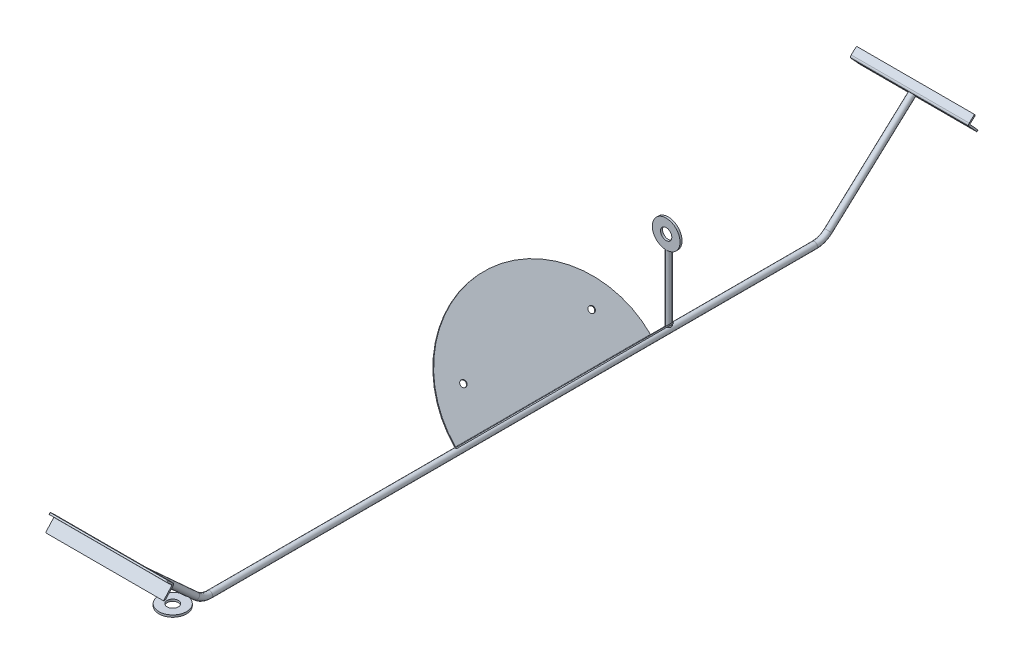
ISO-10303-21;
HEADER;
FILE_DESCRIPTION(('STEP AP214'),'2;1');
FILE_NAME('part.step','',(''),(''),'','','');
FILE_SCHEMA(('AUTOMOTIVE_DESIGN { 1 0 10303 214 1 1 1 1 }'));
ENDSEC;
DATA;
#1=APPLICATION_CONTEXT('core data for automotive mechanical design processes');
#2=APPLICATION_PROTOCOL_DEFINITION('international standard','automotive_design',2000,#1);
#3=PRODUCT_CONTEXT('',#1,'mechanical');
#4=PRODUCT('Part','Part','',(#3));
#5=PRODUCT_RELATED_PRODUCT_CATEGORY('part','',(#4));
#6=PRODUCT_DEFINITION_FORMATION('','',#4);
#7=PRODUCT_DEFINITION_CONTEXT('part definition',#1,'design');
#8=PRODUCT_DEFINITION('design','',#6,#7);
#9=PRODUCT_DEFINITION_SHAPE('','',#8);
#10=(LENGTH_UNIT() NAMED_UNIT(*) SI_UNIT(.MILLI.,.METRE.));
#11=(NAMED_UNIT(*) PLANE_ANGLE_UNIT() SI_UNIT($,.RADIAN.));
#12=(NAMED_UNIT(*) SI_UNIT($,.STERADIAN.) SOLID_ANGLE_UNIT());
#13=UNCERTAINTY_MEASURE_WITH_UNIT(LENGTH_MEASURE(1.E-05),#10,'distance_accuracy_value','');
#14=(GEOMETRIC_REPRESENTATION_CONTEXT(3) GLOBAL_UNCERTAINTY_ASSIGNED_CONTEXT((#13)) GLOBAL_UNIT_ASSIGNED_CONTEXT((#10,
#11,#12)) REPRESENTATION_CONTEXT('',''));
#15=CARTESIAN_POINT('',(0.,0.,0.));
#16=DIRECTION('',(0.,0.,1.));
#17=DIRECTION('',(1.,0.,0.));
#18=AXIS2_PLACEMENT_3D('',#15,#16,#17);
#19=CARTESIAN_POINT('',(0.,10.,330.679966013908));
#20=DIRECTION('',(0.,1.,0.));
#21=DIRECTION('',(0.,0.,1.));
#22=AXIS2_PLACEMENT_3D('',#19,#20,#21);
#23=PLANE('',#22);
#24=CARTESIAN_POINT('',(0.,10.,330.679966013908));
#25=DIRECTION('',(0.,1.,0.));
#26=DIRECTION('',(0.,0.,1.));
#27=AXIS2_PLACEMENT_3D('',#24,#25,#26);
#28=CIRCLE('',#27,13.5);
#29=CARTESIAN_POINT('',(0.,10.,344.179966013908));
#30=VERTEX_POINT('',#29);
#31=EDGE_CURVE('E13',#30,#30,#28,.T.);
#32=ORIENTED_EDGE('',*,*,#31,.T.);
#33=EDGE_LOOP('',(#32));
#34=FACE_BOUND('',#33,.T.);
#35=CARTESIAN_POINT('',(0.,10.,330.679966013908));
#36=DIRECTION('',(0.,1.,0.));
#37=DIRECTION('',(0.,0.,1.));
#38=AXIS2_PLACEMENT_3D('',#35,#36,#37);
#39=CIRCLE('',#38,5.50000000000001);
#40=CARTESIAN_POINT('',(0.,10.,336.179966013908));
#41=VERTEX_POINT('',#40);
#42=EDGE_CURVE('E88',#41,#41,#39,.T.);
#43=ORIENTED_EDGE('',*,*,#42,.F.);
#44=EDGE_LOOP('',(#43));
#45=FACE_BOUND('',#44,.T.);
#46=ADVANCED_FACE('F74',(#34,#45),#23,.T.);
#47=CARTESIAN_POINT('',(0.,8.,330.679966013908));
#48=DIRECTION('',(0.,1.,0.));
#49=DIRECTION('',(0.,0.,1.));
#50=AXIS2_PLACEMENT_3D('',#47,#48,#49);
#51=PLANE('',#50);
#52=CARTESIAN_POINT('',(0.,8.,330.679966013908));
#53=DIRECTION('',(0.,1.,0.));
#54=DIRECTION('',(0.,0.,1.));
#55=AXIS2_PLACEMENT_3D('',#52,#53,#54);
#56=CIRCLE('',#55,13.5);
#57=CARTESIAN_POINT('',(0.,8.,344.179966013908));
#58=VERTEX_POINT('',#57);
#59=EDGE_CURVE('E78',#58,#58,#56,.T.);
#60=ORIENTED_EDGE('',*,*,#59,.F.);
#61=EDGE_LOOP('',(#60));
#62=FACE_BOUND('',#61,.T.);
#63=CARTESIAN_POINT('',(0.,8.,330.679966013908));
#64=DIRECTION('',(0.,1.,0.));
#65=DIRECTION('',(0.,0.,1.));
#66=AXIS2_PLACEMENT_3D('',#63,#64,#65);
#67=CIRCLE('',#66,5.50000000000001);
#68=CARTESIAN_POINT('',(0.,8.,336.179966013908));
#69=VERTEX_POINT('',#68);
#70=EDGE_CURVE('E90',#69,#69,#67,.T.);
#71=ORIENTED_EDGE('',*,*,#70,.T.);
#72=EDGE_LOOP('',(#71));
#73=FACE_BOUND('',#72,.T.);
#74=ADVANCED_FACE('F101',(#62,#73),#51,.F.);
#75=CARTESIAN_POINT('',(0.,10.,330.679966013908));
#76=DIRECTION('',(0.,-1.,0.));
#77=DIRECTION('',(0.,0.,-1.));
#78=AXIS2_PLACEMENT_3D('',#75,#76,#77);
#79=CYLINDRICAL_SURFACE('',#78,13.5);
#80=ORIENTED_EDGE('',*,*,#31,.F.);
#81=EDGE_LOOP('',(#80));
#82=FACE_BOUND('',#81,.T.);
#83=ORIENTED_EDGE('',*,*,#59,.T.);
#84=EDGE_LOOP('',(#83));
#85=FACE_BOUND('',#84,.T.);
#86=ADVANCED_FACE('F76',(#82,#85),#79,.T.);
#87=CARTESIAN_POINT('',(0.,10.,330.679966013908));
#88=DIRECTION('',(0.,-1.,0.));
#89=DIRECTION('',(0.,0.,-1.));
#90=AXIS2_PLACEMENT_3D('',#87,#88,#89);
#91=CYLINDRICAL_SURFACE('',#90,5.50000000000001);
#92=ORIENTED_EDGE('',*,*,#42,.T.);
#93=EDGE_LOOP('',(#92));
#94=FACE_BOUND('',#93,.T.);
#95=ORIENTED_EDGE('',*,*,#70,.F.);
#96=EDGE_LOOP('',(#95));
#97=FACE_BOUND('',#96,.T.);
#98=ADVANCED_FACE('F97',(#94,#97),#91,.F.);
#99=CLOSED_SHELL('',(#46,#74,#86,#98));
#100=MANIFOLD_SOLID_BREP('B2',#99);
#101=CARTESIAN_POINT('',(0.,81.5,-152.264764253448));
#102=DIRECTION('',(0.,0.,-1.));
#103=DIRECTION('',(-1.,0.,0.));
#104=AXIS2_PLACEMENT_3D('',#101,#102,#103);
#105=PLANE('',#104);
#106=CARTESIAN_POINT('',(0.,81.5,-152.264764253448));
#107=DIRECTION('',(0.,0.,-1.));
#108=DIRECTION('',(-1.,0.,0.));
#109=AXIS2_PLACEMENT_3D('',#106,#107,#108);
#110=CIRCLE('',#109,13.5);
#111=CARTESIAN_POINT('',(-13.5,81.5,-152.264764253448));
#112=VERTEX_POINT('',#111);
#113=EDGE_CURVE('E73',#112,#112,#110,.T.);
#114=ORIENTED_EDGE('',*,*,#113,.T.);
#115=EDGE_LOOP('',(#114));
#116=FACE_BOUND('',#115,.T.);
#117=CARTESIAN_POINT('',(0.,81.5,-152.264764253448));
#118=DIRECTION('',(0.,0.,-1.));
#119=DIRECTION('',(-1.,0.,0.));
#120=AXIS2_PLACEMENT_3D('',#117,#118,#119);
#121=CIRCLE('',#120,5.5);
#122=CARTESIAN_POINT('',(-5.5,81.5,-152.264764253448));
#123=VERTEX_POINT('',#122);
#124=EDGE_CURVE('E164',#123,#123,#121,.T.);
#125=ORIENTED_EDGE('',*,*,#124,.F.);
#126=EDGE_LOOP('',(#125));
#127=FACE_BOUND('',#126,.T.);
#128=ADVANCED_FACE('F150',(#116,#127),#105,.T.);
#129=CARTESIAN_POINT('',(0.,81.5,-150.264764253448));
#130=DIRECTION('',(0.,0.,-1.));
#131=DIRECTION('',(-1.,0.,0.));
#132=AXIS2_PLACEMENT_3D('',#129,#130,#131);
#133=PLANE('',#132);
#134=CARTESIAN_POINT('',(0.,81.5,-150.264764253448));
#135=DIRECTION('',(0.,0.,-1.));
#136=DIRECTION('',(-1.,0.,0.));
#137=AXIS2_PLACEMENT_3D('',#134,#135,#136);
#138=CIRCLE('',#137,13.5);
#139=CARTESIAN_POINT('',(-13.5,81.5,-150.264764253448));
#140=VERTEX_POINT('',#139);
#141=EDGE_CURVE('E154',#140,#140,#138,.T.);
#142=ORIENTED_EDGE('',*,*,#141,.F.);
#143=EDGE_LOOP('',(#142));
#144=FACE_BOUND('',#143,.T.);
#145=CARTESIAN_POINT('',(0.,81.5,-150.264764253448));
#146=DIRECTION('',(0.,0.,-1.));
#147=DIRECTION('',(-1.,0.,0.));
#148=AXIS2_PLACEMENT_3D('',#145,#146,#147);
#149=CIRCLE('',#148,5.5);
#150=CARTESIAN_POINT('',(-5.5,81.5,-150.264764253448));
#151=VERTEX_POINT('',#150);
#152=EDGE_CURVE('E166',#151,#151,#149,.T.);
#153=ORIENTED_EDGE('',*,*,#152,.T.);
#154=EDGE_LOOP('',(#153));
#155=FACE_BOUND('',#154,.T.);
#156=ADVANCED_FACE('F177',(#144,#155),#133,.F.);
#157=CARTESIAN_POINT('',(0.,81.5,-152.264764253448));
#158=DIRECTION('',(0.,0.,1.));
#159=DIRECTION('',(1.,0.,0.));
#160=AXIS2_PLACEMENT_3D('',#157,#158,#159);
#161=CYLINDRICAL_SURFACE('',#160,13.5);
#162=ORIENTED_EDGE('',*,*,#113,.F.);
#163=EDGE_LOOP('',(#162));
#164=FACE_BOUND('',#163,.T.);
#165=ORIENTED_EDGE('',*,*,#141,.T.);
#166=EDGE_LOOP('',(#165));
#167=FACE_BOUND('',#166,.T.);
#168=ADVANCED_FACE('F152',(#164,#167),#161,.T.);
#169=CARTESIAN_POINT('',(0.,81.5,-152.264764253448));
#170=DIRECTION('',(0.,0.,1.));
#171=DIRECTION('',(1.,0.,0.));
#172=AXIS2_PLACEMENT_3D('',#169,#170,#171);
#173=CYLINDRICAL_SURFACE('',#172,5.5);
#174=ORIENTED_EDGE('',*,*,#124,.T.);
#175=EDGE_LOOP('',(#174));
#176=FACE_BOUND('',#175,.T.);
#177=ORIENTED_EDGE('',*,*,#152,.F.);
#178=EDGE_LOOP('',(#177));
#179=FACE_BOUND('',#178,.T.);
#180=ADVANCED_FACE('F173',(#176,#179),#173,.F.);
#181=CLOSED_SHELL('',(#128,#156,#168,#180));
#182=MANIFOLD_SOLID_BREP('B8',#181);
#183=CARTESIAN_POINT('',(0.,3.00000000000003,-152.764764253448));
#184=DIRECTION('',(0.,1.,0.));
#185=DIRECTION('',(0.,0.,1.));
#186=AXIS2_PLACEMENT_3D('',#183,#184,#185);
#187=PLANE('',#186);
#188=CARTESIAN_POINT('',(0.,3.00000000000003,-152.764764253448));
#189=DIRECTION('',(0.,1.,0.));
#190=DIRECTION('',(0.,0.,1.));
#191=AXIS2_PLACEMENT_3D('',#188,#189,#190);
#192=CIRCLE('',#191,2.5);
#193=CARTESIAN_POINT('',(0.,3.00000000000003,-150.264764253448));
#194=VERTEX_POINT('',#193);
#195=EDGE_CURVE('E234',#194,#194,#192,.T.);
#196=ORIENTED_EDGE('',*,*,#195,.F.);
#197=EDGE_LOOP('',(#196));
#198=FACE_BOUND('',#197,.T.);
#199=ADVANCED_FACE('F226',(#198),#187,.F.);
#200=CARTESIAN_POINT('',(0.,68.,-152.764764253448));
#201=DIRECTION('',(0.,1.,0.));
#202=DIRECTION('',(0.,0.,1.));
#203=AXIS2_PLACEMENT_3D('',#200,#201,#202);
#204=PLANE('',#203);
#205=CARTESIAN_POINT('',(0.,68.,-152.764764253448));
#206=DIRECTION('',(0.,1.,0.));
#207=DIRECTION('',(0.,0.,1.));
#208=AXIS2_PLACEMENT_3D('',#205,#206,#207);
#209=CIRCLE('',#208,2.5);
#210=CARTESIAN_POINT('',(0.,68.,-150.264764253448));
#211=VERTEX_POINT('',#210);
#212=EDGE_CURVE('E148',#211,#211,#209,.T.);
#213=ORIENTED_EDGE('',*,*,#212,.T.);
#214=EDGE_LOOP('',(#213));
#215=FACE_BOUND('',#214,.T.);
#216=ADVANCED_FACE('F241',(#215),#204,.T.);
#217=CARTESIAN_POINT('',(0.,3.00000000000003,-152.764764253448));
#218=DIRECTION('',(0.,1.,0.));
#219=DIRECTION('',(0.,0.,1.));
#220=AXIS2_PLACEMENT_3D('',#217,#218,#219);
#221=CYLINDRICAL_SURFACE('',#220,2.5);
#222=ORIENTED_EDGE('',*,*,#212,.F.);
#223=EDGE_LOOP('',(#222));
#224=FACE_BOUND('',#223,.T.);
#225=ORIENTED_EDGE('',*,*,#195,.T.);
#226=EDGE_LOOP('',(#225));
#227=FACE_BOUND('',#226,.T.);
#228=ADVANCED_FACE('F243',(#224,#227),#221,.T.);
#229=CLOSED_SHELL('',(#199,#216,#228));
#230=MANIFOLD_SOLID_BREP('B68',#229);
#231=CARTESIAN_POINT('',(0.707106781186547,3.13244410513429,54.7352357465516));
#232=DIRECTION('',(-0.707106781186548,-0.707106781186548,0.));
#233=DIRECTION('',(0.707106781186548,-0.707106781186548,0.));
#234=AXIS2_PLACEMENT_3D('',#231,#232,#233);
#235=PLANE('',#234);
#236=CARTESIAN_POINT('',(-25.1022907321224,28.9418416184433,22.2352357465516));
#237=DIRECTION('',(0.707106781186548,0.707106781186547,0.));
#238=DIRECTION('',(-0.707106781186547,0.707106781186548,0.));
#239=AXIS2_PLACEMENT_3D('',#236,#237,#238);
#240=CIRCLE('',#239,3.);
#241=CARTESIAN_POINT('',(-27.2236110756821,31.0631619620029,22.2352357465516));
#242=VERTEX_POINT('',#241);
#243=EDGE_CURVE('E559',#242,#242,#240,.T.);
#244=ORIENTED_EDGE('',*,*,#243,.F.);
#245=EDGE_LOOP('',(#244));
#246=FACE_BOUND('',#245,.T.);
#247=CARTESIAN_POINT('',(-25.1022907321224,28.9418416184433,-102.764764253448));
#248=DIRECTION('',(0.707106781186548,0.707106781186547,0.));
#249=DIRECTION('',(-0.707106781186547,0.707106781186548,0.));
#250=AXIS2_PLACEMENT_3D('',#247,#248,#249);
#251=CIRCLE('',#250,2.99999999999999);
#252=CARTESIAN_POINT('',(-27.2236110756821,31.0631619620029,-102.764764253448));
#253=VERTEX_POINT('',#252);
#254=EDGE_CURVE('E624',#253,#253,#251,.T.);
#255=ORIENTED_EDGE('',*,*,#254,.F.);
#256=EDGE_LOOP('',(#255));
#257=FACE_BOUND('',#256,.T.);
#258=DIRECTION('',(0.,0.,-1.));
#259=VECTOR('',#258,1.);
#260=CARTESIAN_POINT('',(-0.353553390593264,4.19310427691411,54.7352357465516));
#261=LINE('',#260,#259);
#262=CARTESIAN_POINT('',(-0.353553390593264,4.19310427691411,54.7352357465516));
#263=VERTEX_POINT('',#262);
#264=CARTESIAN_POINT('',(-0.353553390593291,4.19310427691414,-135.264764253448));
#265=VERTEX_POINT('',#264);
#266=EDGE_CURVE('E516',#263,#265,#261,.T.);
#267=ORIENTED_EDGE('',*,*,#266,.T.);
#268=CARTESIAN_POINT('',(-0.353553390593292,4.19310427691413,-40.2647642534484));
#269=DIRECTION('',(-0.707106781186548,-0.707106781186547,0.));
#270=DIRECTION('',(0.707106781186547,-0.707106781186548,0.));
#271=AXIS2_PLACEMENT_3D('',#268,#269,#270);
#272=CIRCLE('',#271,95.);
#273=EDGE_CURVE('E526',#263,#265,#272,.T.);
#274=ORIENTED_EDGE('',*,*,#273,.F.);
#275=EDGE_LOOP('',(#267,#274));
#276=FACE_BOUND('',#275,.T.);
#277=ADVANCED_FACE('F281',(#246,#257,#276),#235,.F.);
#278=CARTESIAN_POINT('',(0.,2.42533732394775,54.7352357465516));
#279=DIRECTION('',(-0.707106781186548,-0.707106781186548,0.));
#280=DIRECTION('',(0.707106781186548,-0.707106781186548,0.));
#281=AXIS2_PLACEMENT_3D('',#278,#279,#280);
#282=PLANE('',#281);
#283=CARTESIAN_POINT('',(-25.809397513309,28.2347348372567,22.2352357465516));
#284=DIRECTION('',(-0.707106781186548,-0.707106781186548,0.));
#285=DIRECTION('',(0.707106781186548,-0.707106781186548,0.));
#286=AXIS2_PLACEMENT_3D('',#283,#284,#285);
#287=CIRCLE('',#286,2.99999999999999);
#288=CARTESIAN_POINT('',(-23.6880771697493,26.1134144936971,22.2352357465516));
#289=VERTEX_POINT('',#288);
#290=EDGE_CURVE('E628',#289,#289,#287,.T.);
#291=ORIENTED_EDGE('',*,*,#290,.F.);
#292=EDGE_LOOP('',(#291));
#293=FACE_BOUND('',#292,.T.);
#294=CARTESIAN_POINT('',(-25.809397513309,28.2347348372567,-102.764764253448));
#295=DIRECTION('',(-0.707106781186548,-0.707106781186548,0.));
#296=DIRECTION('',(0.707106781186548,-0.707106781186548,0.));
#297=AXIS2_PLACEMENT_3D('',#294,#295,#296);
#298=CIRCLE('',#297,2.99999999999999);
#299=CARTESIAN_POINT('',(-23.6880771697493,26.1134144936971,-102.764764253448));
#300=VERTEX_POINT('',#299);
#301=EDGE_CURVE('E567',#300,#300,#298,.T.);
#302=ORIENTED_EDGE('',*,*,#301,.F.);
#303=EDGE_LOOP('',(#302));
#304=FACE_BOUND('',#303,.T.);
#305=CARTESIAN_POINT('',(-1.06066017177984,3.48599749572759,-40.2647642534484));
#306=DIRECTION('',(-0.707106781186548,-0.707106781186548,0.));
#307=DIRECTION('',(0.707106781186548,-0.707106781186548,0.));
#308=AXIS2_PLACEMENT_3D('',#305,#306,#307);
#309=CIRCLE('',#308,95.);
#310=CARTESIAN_POINT('',(-1.06066017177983,3.4859974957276,-135.264764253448));
#311=VERTEX_POINT('',#310);
#312=CARTESIAN_POINT('',(-1.06066017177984,3.48599749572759,54.7352357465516));
#313=VERTEX_POINT('',#312);
#314=EDGE_CURVE('E552',#311,#313,#309,.F.);
#315=ORIENTED_EDGE('',*,*,#314,.F.);
#316=DIRECTION('',(0.,0.,-1.));
#317=VECTOR('',#316,1.);
#318=CARTESIAN_POINT('',(-1.06066017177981,3.48599749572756,54.7352357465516));
#319=LINE('',#318,#317);
#320=EDGE_CURVE('E539',#313,#311,#319,.T.);
#321=ORIENTED_EDGE('',*,*,#320,.F.);
#322=EDGE_LOOP('',(#315,#321));
#323=FACE_BOUND('',#322,.T.);
#324=ADVANCED_FACE('F489',(#293,#304,#323),#282,.T.);
#325=CARTESIAN_POINT('',(4.77548128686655,8.61503217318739,0.));
#326=DIRECTION('',(-0.707106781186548,0.707106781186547,0.));
#327=DIRECTION('',(-0.707106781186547,-0.707106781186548,0.));
#328=AXIS2_PLACEMENT_3D('',#325,#326,#327);
#329=PLANE('',#328);
#330=DIRECTION('',(-0.707106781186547,-0.707106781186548,0.));
#331=VECTOR('',#330,1.);
#332=CARTESIAN_POINT('',(-0.707106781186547,3.13244410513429,54.7352357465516));
#333=LINE('',#332,#331);
#334=CARTESIAN_POINT('',(0.353553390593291,4.19310427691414,54.7352357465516));
#335=VERTEX_POINT('',#334);
#336=CARTESIAN_POINT('',(0.,3.83955088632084,54.7352357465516));
#337=VERTEX_POINT('',#336);
#338=EDGE_CURVE('E550',#335,#337,#333,.T.);
#339=ORIENTED_EDGE('',*,*,#338,.T.);
#340=DIRECTION('',(0.,0.,-1.));
#341=VECTOR('',#340,1.);
#342=CARTESIAN_POINT('',(0.,3.83955088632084,0.));
#343=LINE('',#342,#341);
#344=CARTESIAN_POINT('',(0.,3.83955088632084,54.7339199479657));
#345=VERTEX_POINT('',#344);
#346=EDGE_CURVE('E373',#337,#345,#343,.T.);
#347=ORIENTED_EDGE('',*,*,#346,.T.);
#348=CARTESIAN_POINT('',(0.353553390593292,4.19310427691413,-40.2647642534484));
#349=DIRECTION('',(-0.707106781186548,0.707106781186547,0.));
#350=DIRECTION('',(-0.707106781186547,-0.707106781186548,0.));
#351=AXIS2_PLACEMENT_3D('',#348,#349,#350);
#352=CIRCLE('',#351,95.);
#353=EDGE_CURVE('E414',#345,#335,#352,.T.);
#354=ORIENTED_EDGE('',*,*,#353,.T.);
#355=EDGE_LOOP('',(#339,#347,#354));
#356=FACE_BOUND('',#355,.T.);
#357=ADVANCED_FACE('F472',(#356),#329,.F.);
#358=CARTESIAN_POINT('',(0.353553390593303,4.19310427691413,-135.264764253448));
#359=VERTEX_POINT('',#358);
#360=CARTESIAN_POINT('',(0.,3.83955088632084,-135.263448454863));
#361=VERTEX_POINT('',#360);
#362=EDGE_CURVE('E412',#359,#361,#352,.T.);
#363=ORIENTED_EDGE('',*,*,#362,.T.);
#364=DIRECTION('',(0.,0.,-1.));
#365=VECTOR('',#364,1.);
#366=CARTESIAN_POINT('',(0.,3.83955088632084,0.));
#367=LINE('',#366,#365);
#368=CARTESIAN_POINT('',(0.,3.83955088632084,-135.264764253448));
#369=VERTEX_POINT('',#368);
#370=EDGE_CURVE('E405',#361,#369,#367,.T.);
#371=ORIENTED_EDGE('',*,*,#370,.T.);
#372=DIRECTION('',(0.707106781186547,0.707106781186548,0.));
#373=VECTOR('',#372,1.);
#374=CARTESIAN_POINT('',(0.35355339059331,4.19310427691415,-135.264764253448));
#375=LINE('',#374,#373);
#376=EDGE_CURVE('E510',#369,#359,#375,.T.);
#377=ORIENTED_EDGE('',*,*,#376,.T.);
#378=EDGE_LOOP('',(#363,#371,#377));
#379=FACE_BOUND('',#378,.T.);
#380=ADVANCED_FACE('F618',(#379),#329,.F.);
#381=CARTESIAN_POINT('',(7.42462120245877,-2.87796353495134,-40.2647642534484));
#382=DIRECTION('',(-0.707106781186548,0.707106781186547,0.));
#383=DIRECTION('',(-0.707106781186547,-0.707106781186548,0.));
#384=AXIS2_PLACEMENT_3D('',#381,#382,#383);
#385=CYLINDRICAL_SURFACE('',#384,95.);
#386=DIRECTION('',(-0.707106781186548,0.707106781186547,0.));
#387=VECTOR('',#386,1.);
#388=CARTESIAN_POINT('',(7.07106781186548,-3.23151692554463,54.7339199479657));
#389=LINE('',#388,#387);
#390=CARTESIAN_POINT('',(0.646446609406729,3.19310427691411,54.7339199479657));
#391=VERTEX_POINT('',#390);
#392=EDGE_CURVE('E224',#391,#345,#389,.T.);
#393=ORIENTED_EDGE('',*,*,#392,.F.);
#394=CARTESIAN_POINT('',(1.06066017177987,3.4859974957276,54.7352357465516));
#395=CARTESIAN_POINT('',(1.03082233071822,3.45616006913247,54.7352359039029));
#396=CARTESIAN_POINT('',(0.999739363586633,3.42759638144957,54.7352075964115));
#397=CARTESIAN_POINT('',(0.935280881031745,3.37318833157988,54.7350957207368));
#398=CARTESIAN_POINT('',(0.901905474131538,3.34734384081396,54.7350121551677));
#399=CARTESIAN_POINT('',(0.798738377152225,3.27421775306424,54.7346814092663));
#400=CARTESIAN_POINT('',(0.725812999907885,3.23125091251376,54.7343541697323));
#401=CARTESIAN_POINT('',(0.573793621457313,3.15817414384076,54.7335225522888));
#402=CARTESIAN_POINT('',(0.494697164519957,3.12806936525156,54.7330181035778));
#403=CARTESIAN_POINT('',(0.332572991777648,3.08156358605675,54.7318890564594));
#404=CARTESIAN_POINT('',(0.249545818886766,3.06516069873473,54.7312644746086));
#405=CARTESIAN_POINT('',(0.0818988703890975,3.04652011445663,54.7299653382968));
#406=CARTESIAN_POINT('',(-0.00272142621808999,3.04428713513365,54.7292907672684));
#407=CARTESIAN_POINT('',(-0.171133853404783,3.05407004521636,54.7279679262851));
#408=CARTESIAN_POINT('',(-0.254926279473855,3.06608065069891,54.7273196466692));
#409=CARTESIAN_POINT('',(-0.390453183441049,3.09732869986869,54.7263324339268));
#410=CARTESIAN_POINT('',(-0.443143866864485,3.11256574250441,54.725964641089));
#411=CARTESIAN_POINT('',(-0.546460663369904,3.14866857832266,54.7252884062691));
#412=CARTESIAN_POINT('',(-0.597090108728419,3.1695248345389,54.7249798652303));
#413=CARTESIAN_POINT('',(-0.646446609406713,3.19310427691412,54.7247088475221));
#414=B_SPLINE_CURVE_WITH_KNOTS('',3,(#394,#395,#396,#397,#398,#399,#400,#401,#402,#403,#404,
#405,#406,#407,#408,#409,#410,#411,#412,#413),.UNSPECIFIED.,.F.,.F.,(4,2,2,2,2,2,2,2,2,4),(0.,
0.126512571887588,0.253019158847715,0.505643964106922,0.758369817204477,1.0110608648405,
1.26383603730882,1.5165174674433,1.68076510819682,1.84473572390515),.UNSPECIFIED.);
#415=CARTESIAN_POINT('',(1.06066017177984,3.48599749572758,54.7352357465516));
#416=VERTEX_POINT('',#415);
#417=EDGE_CURVE('E391',#416,#391,#414,.T.);
#418=ORIENTED_EDGE('',*,*,#417,.F.);
#419=CARTESIAN_POINT('',(1.06066017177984,3.48599749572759,-40.2647642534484));
#420=DIRECTION('',(0.707106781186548,-0.707106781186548,0.));
#421=DIRECTION('',(0.707106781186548,0.707106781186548,0.));
#422=AXIS2_PLACEMENT_3D('',#419,#420,#421);
#423=CIRCLE('',#422,95.);
#424=CARTESIAN_POINT('',(1.06066017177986,3.4859974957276,-135.264764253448));
#425=VERTEX_POINT('',#424);
#426=EDGE_CURVE('E430',#425,#416,#423,.T.);
#427=ORIENTED_EDGE('',*,*,#426,.F.);
#428=CARTESIAN_POINT('',(-0.646446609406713,3.19310427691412,-135.254237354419));
#429=CARTESIAN_POINT('',(-0.608366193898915,3.17491769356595,-135.254446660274));
#430=CARTESIAN_POINT('',(-0.569536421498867,3.15834736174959,-135.254678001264));
#431=CARTESIAN_POINT('',(-0.490621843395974,3.1285352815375,-135.255177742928));
#432=CARTESIAN_POINT('',(-0.450537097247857,3.11529337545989,-135.255446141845));
#433=CARTESIAN_POINT('',(-0.328884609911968,3.08073733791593,-135.256295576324));
#434=CARTESIAN_POINT('',(-0.24580056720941,3.06453664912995,-135.256921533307));
#435=CARTESIAN_POINT('',(-0.0781019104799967,3.04631540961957,-135.258222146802));
#436=CARTESIAN_POINT('',(0.00651330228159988,3.0443005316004,-135.258896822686));
#437=CARTESIAN_POINT('',(0.174882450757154,3.054503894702,-135.260218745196));
#438=CARTESIAN_POINT('',(0.258636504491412,3.06672015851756,-135.260865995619));
#439=CARTESIAN_POINT('',(0.422920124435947,3.105040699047,-135.262060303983));
#440=CARTESIAN_POINT('',(0.50344876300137,3.13114894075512,-135.26260733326));
#441=CARTESIAN_POINT('',(0.65897455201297,3.19652505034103,-135.263539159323));
#442=CARTESIAN_POINT('',(0.733973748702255,3.23578802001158,-135.263924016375));
#443=CARTESIAN_POINT('',(0.85131571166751,3.31042649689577,-135.264389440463));
#444=CARTESIAN_POINT('',(0.895895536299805,3.34234661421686,-135.264529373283));
#445=CARTESIAN_POINT('',(0.981234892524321,3.4108017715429,-135.264717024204));
#446=CARTESIAN_POINT('',(1.02200074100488,3.44732893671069,-135.264764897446));
#447=CARTESIAN_POINT('',(1.06066017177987,3.4859974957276,-135.264764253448));
#448=B_SPLINE_CURVE_WITH_KNOTS('',3,(#428,#429,#430,#431,#432,#433,#434,#435,#436,#437,#438,
#439,#440,#441,#442,#443,#444,#445,#446,#447),.UNSPECIFIED.,.F.,.F.,(4,2,2,2,2,2,2,2,2,4),(0.,
0.126524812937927,0.25304363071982,0.505693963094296,0.758445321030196,1.01116156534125,
1.26394997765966,1.5166443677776,1.6808284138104,1.84473552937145),.UNSPECIFIED.);
#449=CARTESIAN_POINT('',(0.646446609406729,3.19310427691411,-135.263448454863));
#450=VERTEX_POINT('',#449);
#451=EDGE_CURVE('E435',#450,#425,#448,.T.);
#452=ORIENTED_EDGE('',*,*,#451,.F.);
#453=DIRECTION('',(-0.707106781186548,0.707106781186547,0.));
#454=VECTOR('',#453,1.);
#455=CARTESIAN_POINT('',(7.07106781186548,-3.23151692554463,-135.263448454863));
#456=LINE('',#455,#454);
#457=EDGE_CURVE('E546',#361,#450,#456,.F.);
#458=ORIENTED_EDGE('',*,*,#457,.F.);
#459=ORIENTED_EDGE('',*,*,#362,.F.);
#460=EDGE_CURVE('E431',#335,#359,#352,.T.);
#461=ORIENTED_EDGE('',*,*,#460,.F.);
#462=ORIENTED_EDGE('',*,*,#353,.F.);
#463=EDGE_LOOP('',(#393,#418,#427,#452,#458,#459,#461,#462));
#464=FACE_BOUND('',#463,.T.);
#465=ADVANCED_FACE('F463',(#464),#385,.T.);
#466=CARTESIAN_POINT('',(0.,4.54665766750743,-40.2647642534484));
#467=DIRECTION('',(-1.,0.,0.));
#468=DIRECTION('',(0.,1.,0.));
#469=AXIS2_PLACEMENT_3D('',#466,#467,#468);
#470=ELLIPSE('',#469,134.350288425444,95.);
#471=CARTESIAN_POINT('',(0.,3.04665766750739,54.7293145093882));
#472=VERTEX_POINT('',#471);
#473=EDGE_CURVE('E291',#345,#472,#470,.F.);
#474=ORIENTED_EDGE('',*,*,#473,.F.);
#475=CARTESIAN_POINT('',(-0.646446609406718,3.19310427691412,54.7247088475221));
#476=VERTEX_POINT('',#475);
#477=EDGE_CURVE('E426',#476,#345,#352,.T.);
#478=ORIENTED_EDGE('',*,*,#477,.F.);
#479=EDGE_CURVE('E446',#472,#476,#414,.T.);
#480=ORIENTED_EDGE('',*,*,#479,.F.);
#481=EDGE_LOOP('',(#474,#478,#480));
#482=FACE_BOUND('',#481,.T.);
#483=ADVANCED_FACE('F464',(#482),#385,.T.);
#484=CARTESIAN_POINT('',(70.7106781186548,73.1360154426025,54.7352357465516));
#485=DIRECTION('',(0.707106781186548,-0.707106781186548,0.));
#486=DIRECTION('',(0.707106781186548,0.707106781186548,0.));
#487=AXIS2_PLACEMENT_3D('',#484,#485,#486);
#488=PLANE('',#487);
#489=CARTESIAN_POINT('',(25.809397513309,28.2347348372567,22.2352357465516));
#490=DIRECTION('',(0.707106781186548,-0.707106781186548,0.));
#491=DIRECTION('',(0.707106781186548,0.707106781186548,0.));
#492=AXIS2_PLACEMENT_3D('',#489,#490,#491);
#493=CIRCLE('',#492,2.99999999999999);
#494=CARTESIAN_POINT('',(27.9307178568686,30.3560551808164,22.2352357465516));
#495=VERTEX_POINT('',#494);
#496=EDGE_CURVE('E640',#495,#495,#493,.T.);
#497=ORIENTED_EDGE('',*,*,#496,.F.);
#498=EDGE_LOOP('',(#497));
#499=FACE_BOUND('',#498,.T.);
#500=CARTESIAN_POINT('',(25.809397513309,28.2347348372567,-102.764764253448));
#501=DIRECTION('',(0.707106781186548,-0.707106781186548,0.));
#502=DIRECTION('',(0.707106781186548,0.707106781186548,0.));
#503=AXIS2_PLACEMENT_3D('',#500,#501,#502);
#504=CIRCLE('',#503,2.99999999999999);
#505=CARTESIAN_POINT('',(27.9307178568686,30.3560551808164,-102.764764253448));
#506=VERTEX_POINT('',#505);
#507=EDGE_CURVE('E285',#506,#506,#504,.T.);
#508=ORIENTED_EDGE('',*,*,#507,.F.);
#509=EDGE_LOOP('',(#508));
#510=FACE_BOUND('',#509,.T.);
#511=DIRECTION('',(0.,0.,-1.));
#512=VECTOR('',#511,1.);
#513=CARTESIAN_POINT('',(1.06066017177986,3.4859974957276,54.7352357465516));
#514=LINE('',#513,#512);
#515=EDGE_CURVE('E531',#416,#425,#514,.T.);
#516=ORIENTED_EDGE('',*,*,#515,.T.);
#517=ORIENTED_EDGE('',*,*,#426,.T.);
#518=EDGE_LOOP('',(#516,#517));
#519=FACE_BOUND('',#518,.T.);
#520=ADVANCED_FACE('F478',(#499,#510,#519),#488,.T.);
#521=CARTESIAN_POINT('',(70.0035713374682,73.843122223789,54.7352357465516));
#522=DIRECTION('',(0.707106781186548,-0.707106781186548,0.));
#523=DIRECTION('',(0.707106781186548,0.707106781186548,0.));
#524=AXIS2_PLACEMENT_3D('',#521,#522,#523);
#525=PLANE('',#524);
#526=CARTESIAN_POINT('',(25.1022907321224,28.9418416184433,22.2352357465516));
#527=DIRECTION('',(-0.707106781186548,0.707106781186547,0.));
#528=DIRECTION('',(-0.707106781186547,-0.707106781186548,0.));
#529=AXIS2_PLACEMENT_3D('',#526,#527,#528);
#530=CIRCLE('',#529,3.);
#531=CARTESIAN_POINT('',(22.9809703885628,26.8205212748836,22.2352357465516));
#532=VERTEX_POINT('',#531);
#533=EDGE_CURVE('E644',#532,#532,#530,.T.);
#534=ORIENTED_EDGE('',*,*,#533,.F.);
#535=EDGE_LOOP('',(#534));
#536=FACE_BOUND('',#535,.T.);
#537=CARTESIAN_POINT('',(25.1022907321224,28.9418416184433,-102.764764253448));
#538=DIRECTION('',(-0.707106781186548,0.707106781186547,0.));
#539=DIRECTION('',(-0.707106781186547,-0.707106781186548,0.));
#540=AXIS2_PLACEMENT_3D('',#537,#538,#539);
#541=CIRCLE('',#540,2.99999999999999);
#542=CARTESIAN_POINT('',(22.9809703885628,26.8205212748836,-102.764764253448));
#543=VERTEX_POINT('',#542);
#544=EDGE_CURVE('E560',#543,#543,#541,.T.);
#545=ORIENTED_EDGE('',*,*,#544,.F.);
#546=EDGE_LOOP('',(#545));
#547=FACE_BOUND('',#546,.T.);
#548=ORIENTED_EDGE('',*,*,#460,.T.);
#549=DIRECTION('',(0.,0.,-1.));
#550=VECTOR('',#549,1.);
#551=CARTESIAN_POINT('',(0.353553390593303,4.19310427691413,54.7352357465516));
#552=LINE('',#551,#550);
#553=EDGE_CURVE('E518',#335,#359,#552,.T.);
#554=ORIENTED_EDGE('',*,*,#553,.F.);
#555=EDGE_LOOP('',(#548,#554));
#556=FACE_BOUND('',#555,.T.);
#557=ADVANCED_FACE('F476',(#536,#547,#556),#525,.F.);
#558=CARTESIAN_POINT('',(-1.06066017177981,3.48599749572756,54.7352357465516));
#559=DIRECTION('',(0.,0.,1.));
#560=DIRECTION('',(1.,0.,0.));
#561=AXIS2_PLACEMENT_3D('',#558,#559,#560);
#562=PLANE('',#561);
#563=DIRECTION('',(-0.707106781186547,0.707106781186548,0.));
#564=VECTOR('',#563,1.);
#565=CARTESIAN_POINT('',(-0.353553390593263,4.19310427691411,54.7352357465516));
#566=LINE('',#565,#564);
#567=EDGE_CURVE('E393',#337,#263,#566,.T.);
#568=ORIENTED_EDGE('',*,*,#567,.F.);
#569=ORIENTED_EDGE('',*,*,#338,.F.);
#570=CARTESIAN_POINT('',(0.,4.54665766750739,54.7352357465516));
#571=DIRECTION('',(0.,0.,1.));
#572=DIRECTION('',(1.,0.,0.));
#573=AXIS2_PLACEMENT_3D('',#570,#571,#572);
#574=CIRCLE('',#573,0.5);
#575=EDGE_CURVE('E520',#335,#263,#574,.F.);
#576=ORIENTED_EDGE('',*,*,#575,.T.);
#577=EDGE_LOOP('',(#568,#569,#576));
#578=FACE_BOUND('',#577,.T.);
#579=ADVANCED_FACE('F283',(#578),#562,.T.);
#580=CARTESIAN_POINT('',(1.06066017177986,3.4859974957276,-135.264764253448));
#581=DIRECTION('',(0.,0.,-1.));
#582=DIRECTION('',(-1.,0.,0.));
#583=AXIS2_PLACEMENT_3D('',#580,#581,#582);
#584=PLANE('',#583);
#585=DIRECTION('',(0.707106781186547,-0.707106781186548,0.));
#586=VECTOR('',#585,1.);
#587=CARTESIAN_POINT('',(0.70710678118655,3.13244410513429,-135.264764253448));
#588=LINE('',#587,#586);
#589=EDGE_CURVE('E398',#265,#369,#588,.T.);
#590=ORIENTED_EDGE('',*,*,#589,.F.);
#591=CARTESIAN_POINT('',(0.,4.54665766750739,-135.264764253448));
#592=DIRECTION('',(0.,0.,1.));
#593=DIRECTION('',(1.,0.,0.));
#594=AXIS2_PLACEMENT_3D('',#591,#592,#593);
#595=CIRCLE('',#594,0.5);
#596=EDGE_CURVE('E509',#359,#265,#595,.F.);
#597=ORIENTED_EDGE('',*,*,#596,.F.);
#598=ORIENTED_EDGE('',*,*,#376,.F.);
#599=EDGE_LOOP('',(#590,#597,#598));
#600=FACE_BOUND('',#599,.T.);
#601=ADVANCED_FACE('F498',(#600),#584,.T.);
#602=CARTESIAN_POINT('',(0.,4.54665766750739,54.7352357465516));
#603=DIRECTION('',(0.,0.,-1.));
#604=DIRECTION('',(-1.,0.,0.));
#605=AXIS2_PLACEMENT_3D('',#602,#603,#604);
#606=CYLINDRICAL_SURFACE('',#605,1.5);
#607=CARTESIAN_POINT('',(-1.0606601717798,3.48599749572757,54.7352357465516));
#608=CARTESIAN_POINT('',(-1.03082233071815,3.45616006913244,54.7352359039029));
#609=CARTESIAN_POINT('',(-0.999739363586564,3.42759638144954,54.7352075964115));
#610=CARTESIAN_POINT('',(-0.935280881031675,3.37318833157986,54.7350957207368));
#611=CARTESIAN_POINT('',(-0.901905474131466,3.34734384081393,54.7350121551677));
#612=CARTESIAN_POINT('',(-0.798738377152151,3.27421775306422,54.7346814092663));
#613=CARTESIAN_POINT('',(-0.72581299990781,3.23125091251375,54.7343541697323));
#614=CARTESIAN_POINT('',(-0.573793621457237,3.15817414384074,54.7335225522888));
#615=CARTESIAN_POINT('',(-0.49469716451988,3.12806936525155,54.7330181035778));
#616=CARTESIAN_POINT('',(-0.33257299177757,3.08156358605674,54.7318890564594));
#617=CARTESIAN_POINT('',(-0.249545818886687,3.06516069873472,54.7312644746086));
#618=CARTESIAN_POINT('',(-0.0818988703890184,3.04652011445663,54.7299653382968));
#619=CARTESIAN_POINT('',(0.00272142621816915,3.04428713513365,54.7292907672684));
#620=CARTESIAN_POINT('',(0.171133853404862,3.05407004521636,54.7279679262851));
#621=CARTESIAN_POINT('',(0.254926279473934,3.06608065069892,54.7273196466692));
#622=CARTESIAN_POINT('',(0.390453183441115,3.0973286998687,54.7263324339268));
#623=CARTESIAN_POINT('',(0.443143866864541,3.11256574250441,54.725964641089));
#624=CARTESIAN_POINT('',(0.546460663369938,3.14866857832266,54.7252884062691));
#625=CARTESIAN_POINT('',(0.597090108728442,3.16952483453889,54.7249798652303));
#626=CARTESIAN_POINT('',(0.646446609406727,3.19310427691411,54.7247088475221));
#627=B_SPLINE_CURVE_WITH_KNOTS('',3,(#607,#608,#609,#610,#611,#612,#613,#614,#615,#616,#617,
#618,#619,#620,#621,#622,#623,#624,#625,#626),.UNSPECIFIED.,.F.,.F.,(4,2,2,2,2,2,2,2,2,4),(0.,
0.126512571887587,0.253019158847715,0.505643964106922,0.758369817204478,1.0110608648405,
1.26383603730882,1.5165174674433,1.68076510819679,1.84473572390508),.UNSPECIFIED.);
#628=CARTESIAN_POINT('',(-0.646446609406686,3.19310427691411,54.7339199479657));
#629=VERTEX_POINT('',#628);
#630=EDGE_CURVE('E376',#313,#629,#627,.T.);
#631=ORIENTED_EDGE('',*,*,#630,.F.);
#632=ORIENTED_EDGE('',*,*,#320,.T.);
#633=CARTESIAN_POINT('',(0.646446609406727,3.19310427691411,-135.254237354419));
#634=CARTESIAN_POINT('',(0.608366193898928,3.17491769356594,-135.254446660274));
#635=CARTESIAN_POINT('',(0.56953642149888,3.15834736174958,-135.254678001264));
#636=CARTESIAN_POINT('',(0.490621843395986,3.12853528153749,-135.255177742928));
#637=CARTESIAN_POINT('',(0.450537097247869,3.11529337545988,-135.255446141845));
#638=CARTESIAN_POINT('',(0.32888460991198,3.08073733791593,-135.256295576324));
#639=CARTESIAN_POINT('',(0.245800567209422,3.06453664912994,-135.256921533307));
#640=CARTESIAN_POINT('',(0.0781019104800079,3.04631540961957,-135.258222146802));
#641=CARTESIAN_POINT('',(-0.00651330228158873,3.0443005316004,-135.258896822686));
#642=CARTESIAN_POINT('',(-0.174882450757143,3.054503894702,-135.260218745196));
#643=CARTESIAN_POINT('',(-0.2586365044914,3.06672015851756,-135.260865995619));
#644=CARTESIAN_POINT('',(-0.422920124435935,3.105040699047,-135.262060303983));
#645=CARTESIAN_POINT('',(-0.503448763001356,3.13114894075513,-135.26260733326));
#646=CARTESIAN_POINT('',(-0.658974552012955,3.19652505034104,-135.263539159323));
#647=CARTESIAN_POINT('',(-0.73397374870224,3.2357880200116,-135.263924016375));
#648=CARTESIAN_POINT('',(-0.85131571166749,3.31042649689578,-135.264389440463));
#649=CARTESIAN_POINT('',(-0.895895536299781,3.34234661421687,-135.264529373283));
#650=CARTESIAN_POINT('',(-0.981234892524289,3.41080177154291,-135.264717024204));
#651=CARTESIAN_POINT('',(-1.02200074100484,3.4473289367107,-135.264764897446));
#652=CARTESIAN_POINT('',(-1.06066017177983,3.4859974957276,-135.264764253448));
#653=B_SPLINE_CURVE_WITH_KNOTS('',3,(#633,#634,#635,#636,#637,#638,#639,#640,#641,#642,#643,
#644,#645,#646,#647,#648,#649,#650,#651,#652),.UNSPECIFIED.,.F.,.F.,(4,2,2,2,2,2,2,2,2,4),(0.,
0.126524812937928,0.25304363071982,0.505693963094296,0.758445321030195,1.01116156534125,
1.26394997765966,1.5166443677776,1.68082841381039,1.84473552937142),.UNSPECIFIED.);
#654=CARTESIAN_POINT('',(-0.646446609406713,3.19310427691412,-135.263448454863));
#655=VERTEX_POINT('',#654);
#656=EDGE_CURVE('E553',#655,#311,#653,.T.);
#657=ORIENTED_EDGE('',*,*,#656,.F.);
#658=DIRECTION('',(0.,0.,-1.));
#659=VECTOR('',#658,1.);
#660=CARTESIAN_POINT('',(-0.646446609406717,3.19310427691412,54.7352357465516));
#661=LINE('',#660,#659);
#662=CARTESIAN_POINT('',(-0.646446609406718,3.19310427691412,-135.254237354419));
#663=VERTEX_POINT('',#662);
#664=EDGE_CURVE('E598',#663,#655,#661,.T.);
#665=ORIENTED_EDGE('',*,*,#664,.F.);
#666=CARTESIAN_POINT('',(0.,3.04665766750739,-135.258843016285));
#667=VERTEX_POINT('',#666);
#668=EDGE_CURVE('E436',#663,#667,#448,.T.);
#669=ORIENTED_EDGE('',*,*,#668,.T.);
#670=CARTESIAN_POINT('',(0.646446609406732,3.19310427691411,-135.254237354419));
#671=VERTEX_POINT('',#670);
#672=EDGE_CURVE('E305',#671,#667,#653,.T.);
#673=ORIENTED_EDGE('',*,*,#672,.F.);
#674=DIRECTION('',(0.,0.,-1.));
#675=VECTOR('',#674,1.);
#676=CARTESIAN_POINT('',(0.646446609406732,3.19310427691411,54.7352357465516));
#677=LINE('',#676,#675);
#678=EDGE_CURVE('E395',#450,#671,#677,.F.);
#679=ORIENTED_EDGE('',*,*,#678,.F.);
#680=ORIENTED_EDGE('',*,*,#451,.T.);
#681=ORIENTED_EDGE('',*,*,#515,.F.);
#682=ORIENTED_EDGE('',*,*,#417,.T.);
#683=CARTESIAN_POINT('',(0.646446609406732,3.19310427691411,54.7247088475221));
#684=VERTEX_POINT('',#683);
#685=EDGE_CURVE('E379',#684,#391,#677,.F.);
#686=ORIENTED_EDGE('',*,*,#685,.F.);
#687=EDGE_CURVE('E365',#472,#684,#627,.T.);
#688=ORIENTED_EDGE('',*,*,#687,.F.);
#689=ORIENTED_EDGE('',*,*,#479,.T.);
#690=EDGE_CURVE('E521',#629,#476,#661,.T.);
#691=ORIENTED_EDGE('',*,*,#690,.F.);
#692=EDGE_LOOP('',(#631,#632,#657,#665,#669,#673,#679,#680,#681,#682,#686,#688,#689,#691));
#693=FACE_BOUND('',#692,.T.);
#694=ADVANCED_FACE('F389',(#693),#606,.T.);
#695=CARTESIAN_POINT('',(0.,4.54665766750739,54.7352357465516));
#696=DIRECTION('',(0.,0.,-1.));
#697=DIRECTION('',(-1.,0.,0.));
#698=AXIS2_PLACEMENT_3D('',#695,#696,#697);
#699=CYLINDRICAL_SURFACE('',#698,0.5);
#700=ORIENTED_EDGE('',*,*,#596,.T.);
#701=ORIENTED_EDGE('',*,*,#266,.F.);
#702=ORIENTED_EDGE('',*,*,#575,.F.);
#703=ORIENTED_EDGE('',*,*,#553,.T.);
#704=EDGE_LOOP('',(#700,#701,#702,#703));
#705=FACE_BOUND('',#704,.T.);
#706=ADVANCED_FACE('F470',(#705),#699,.F.);
#707=ORIENTED_EDGE('',*,*,#477,.T.);
#708=DIRECTION('',(0.707106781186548,0.707106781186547,0.));
#709=VECTOR('',#708,1.);
#710=CARTESIAN_POINT('',(-7.07106781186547,-3.23151692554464,54.7339199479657));
#711=LINE('',#710,#709);
#712=EDGE_CURVE('E374',#345,#629,#711,.F.);
#713=ORIENTED_EDGE('',*,*,#712,.T.);
#714=ORIENTED_EDGE('',*,*,#690,.T.);
#715=EDGE_LOOP('',(#707,#713,#714));
#716=FACE_BOUND('',#715,.T.);
#717=ADVANCED_FACE('F466',(#716),#329,.F.);
#718=ORIENTED_EDGE('',*,*,#664,.T.);
#719=DIRECTION('',(0.707106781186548,0.707106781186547,0.));
#720=VECTOR('',#719,1.);
#721=CARTESIAN_POINT('',(-7.07106781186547,-3.23151692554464,-135.263448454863));
#722=LINE('',#721,#720);
#723=EDGE_CURVE('E383',#655,#361,#722,.T.);
#724=ORIENTED_EDGE('',*,*,#723,.T.);
#725=EDGE_CURVE('E404',#361,#663,#352,.T.);
#726=ORIENTED_EDGE('',*,*,#725,.T.);
#727=EDGE_LOOP('',(#718,#724,#726));
#728=FACE_BOUND('',#727,.T.);
#729=ADVANCED_FACE('F461',(#728),#329,.F.);
#730=EDGE_CURVE('E543',#667,#361,#470,.F.);
#731=ORIENTED_EDGE('',*,*,#730,.F.);
#732=ORIENTED_EDGE('',*,*,#668,.F.);
#733=ORIENTED_EDGE('',*,*,#725,.F.);
#734=EDGE_LOOP('',(#731,#732,#733));
#735=FACE_BOUND('',#734,.T.);
#736=ADVANCED_FACE('F455',(#735),#385,.T.);
#737=CARTESIAN_POINT('',(-7.42462120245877,-2.87796353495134,-40.2647642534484));
#738=DIRECTION('',(0.707106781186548,0.707106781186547,0.));
#739=DIRECTION('',(-0.707106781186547,0.707106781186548,0.));
#740=AXIS2_PLACEMENT_3D('',#737,#738,#739);
#741=CYLINDRICAL_SURFACE('',#740,95.);
#742=ORIENTED_EDGE('',*,*,#672,.T.);
#743=ORIENTED_EDGE('',*,*,#730,.T.);
#744=EDGE_CURVE('E386',#361,#671,#272,.T.);
#745=ORIENTED_EDGE('',*,*,#744,.T.);
#746=EDGE_LOOP('',(#742,#743,#745));
#747=FACE_BOUND('',#746,.T.);
#748=ADVANCED_FACE('F460',(#747),#741,.T.);
#749=CARTESIAN_POINT('',(-1.41421356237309,5.25376444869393,-40.2647724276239));
#750=DIRECTION('',(0.707106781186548,0.707106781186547,0.));
#751=DIRECTION('',(-0.707106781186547,0.707106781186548,0.));
#752=AXIS2_PLACEMENT_3D('',#749,#750,#751);
#753=PLANE('',#752);
#754=ORIENTED_EDGE('',*,*,#678,.T.);
#755=ORIENTED_EDGE('',*,*,#744,.F.);
#756=ORIENTED_EDGE('',*,*,#457,.T.);
#757=EDGE_LOOP('',(#754,#755,#756));
#758=FACE_BOUND('',#757,.T.);
#759=ADVANCED_FACE('F580',(#758),#753,.F.);
#760=ORIENTED_EDGE('',*,*,#687,.T.);
#761=EDGE_CURVE('E298',#684,#345,#272,.T.);
#762=ORIENTED_EDGE('',*,*,#761,.T.);
#763=ORIENTED_EDGE('',*,*,#473,.T.);
#764=EDGE_LOOP('',(#760,#762,#763));
#765=FACE_BOUND('',#764,.T.);
#766=ADVANCED_FACE('F366',(#765),#741,.T.);
#767=ORIENTED_EDGE('',*,*,#685,.T.);
#768=ORIENTED_EDGE('',*,*,#392,.T.);
#769=ORIENTED_EDGE('',*,*,#761,.F.);
#770=EDGE_LOOP('',(#767,#768,#769));
#771=FACE_BOUND('',#770,.T.);
#772=ADVANCED_FACE('F378',(#771),#753,.F.);
#773=EDGE_CURVE('E561',#265,#361,#272,.T.);
#774=ORIENTED_EDGE('',*,*,#773,.F.);
#775=ORIENTED_EDGE('',*,*,#589,.T.);
#776=ORIENTED_EDGE('',*,*,#370,.F.);
#777=EDGE_LOOP('',(#774,#775,#776));
#778=FACE_BOUND('',#777,.T.);
#779=ADVANCED_FACE('F682',(#778),#753,.F.);
#780=ORIENTED_EDGE('',*,*,#567,.T.);
#781=EDGE_CURVE('E384',#345,#263,#272,.T.);
#782=ORIENTED_EDGE('',*,*,#781,.F.);
#783=ORIENTED_EDGE('',*,*,#346,.F.);
#784=EDGE_LOOP('',(#780,#782,#783));
#785=FACE_BOUND('',#784,.T.);
#786=ADVANCED_FACE('F681',(#785),#753,.F.);
#787=ORIENTED_EDGE('',*,*,#773,.T.);
#788=ORIENTED_EDGE('',*,*,#723,.F.);
#789=ORIENTED_EDGE('',*,*,#656,.T.);
#790=ORIENTED_EDGE('',*,*,#314,.T.);
#791=ORIENTED_EDGE('',*,*,#630,.T.);
#792=ORIENTED_EDGE('',*,*,#712,.F.);
#793=ORIENTED_EDGE('',*,*,#781,.T.);
#794=ORIENTED_EDGE('',*,*,#273,.T.);
#795=EDGE_LOOP('',(#787,#788,#789,#790,#791,#792,#793,#794));
#796=FACE_BOUND('',#795,.T.);
#797=ADVANCED_FACE('F581',(#796),#741,.T.);
#798=CARTESIAN_POINT('',(-25.1022907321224,28.9418416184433,-102.764764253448));
#799=DIRECTION('',(0.707106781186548,0.707106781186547,0.));
#800=DIRECTION('',(-0.707106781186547,0.707106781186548,0.));
#801=AXIS2_PLACEMENT_3D('',#798,#799,#800);
#802=CYLINDRICAL_SURFACE('',#801,2.99999999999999);
#803=ORIENTED_EDGE('',*,*,#301,.T.);
#804=EDGE_LOOP('',(#803));
#805=FACE_BOUND('',#804,.T.);
#806=ORIENTED_EDGE('',*,*,#254,.T.);
#807=EDGE_LOOP('',(#806));
#808=FACE_BOUND('',#807,.T.);
#809=ADVANCED_FACE('F582',(#805,#808),#802,.F.);
#810=CARTESIAN_POINT('',(-25.1022907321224,28.9418416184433,22.2352357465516));
#811=DIRECTION('',(0.707106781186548,0.707106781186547,0.));
#812=DIRECTION('',(-0.707106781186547,0.707106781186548,0.));
#813=AXIS2_PLACEMENT_3D('',#810,#811,#812);
#814=CYLINDRICAL_SURFACE('',#813,2.99999999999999);
#815=ORIENTED_EDGE('',*,*,#290,.T.);
#816=EDGE_LOOP('',(#815));
#817=FACE_BOUND('',#816,.T.);
#818=ORIENTED_EDGE('',*,*,#243,.T.);
#819=EDGE_LOOP('',(#818));
#820=FACE_BOUND('',#819,.T.);
#821=ADVANCED_FACE('F655',(#817,#820),#814,.F.);
#822=CARTESIAN_POINT('',(25.1022907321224,28.9418416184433,-102.764764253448));
#823=DIRECTION('',(-0.707106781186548,0.707106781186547,0.));
#824=DIRECTION('',(-0.707106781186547,-0.707106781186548,0.));
#825=AXIS2_PLACEMENT_3D('',#822,#823,#824);
#826=CYLINDRICAL_SURFACE('',#825,2.99999999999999);
#827=ORIENTED_EDGE('',*,*,#507,.T.);
#828=EDGE_LOOP('',(#827));
#829=FACE_BOUND('',#828,.T.);
#830=ORIENTED_EDGE('',*,*,#544,.T.);
#831=EDGE_LOOP('',(#830));
#832=FACE_BOUND('',#831,.T.);
#833=ADVANCED_FACE('F653',(#829,#832),#826,.F.);
#834=CARTESIAN_POINT('',(25.1022907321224,28.9418416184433,22.2352357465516));
#835=DIRECTION('',(-0.707106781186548,0.707106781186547,0.));
#836=DIRECTION('',(-0.707106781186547,-0.707106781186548,0.));
#837=AXIS2_PLACEMENT_3D('',#834,#835,#836);
#838=CYLINDRICAL_SURFACE('',#837,2.99999999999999);
#839=ORIENTED_EDGE('',*,*,#496,.T.);
#840=EDGE_LOOP('',(#839));
#841=FACE_BOUND('',#840,.T.);
#842=ORIENTED_EDGE('',*,*,#533,.T.);
#843=EDGE_LOOP('',(#842));
#844=FACE_BOUND('',#843,.T.);
#845=ADVANCED_FACE('F649',(#841,#844),#838,.F.);
#846=CLOSED_SHELL('',(#277,#324,#357,#380,#465,#483,#520,#557,#579,#601,#694,#706,#717,#729,
#736,#748,#759,#766,#772,#779,#786,#797,#809,#821,#833,#845));
#847=MANIFOLD_SOLID_BREP('B142',#846);
#848=CARTESIAN_POINT('',(57.5,85.0396824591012,388.10221162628));
#849=DIRECTION('',(1.,0.,0.));
#850=DIRECTION('',(0.,0.,1.));
#851=AXIS2_PLACEMENT_3D('',#848,#849,#850);
#852=PLANE('',#851);
#853=DIRECTION('',(0.,-0.738028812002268,0.674769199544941));
#854=VECTOR('',#853,1.);
#855=CARTESIAN_POINT('',(57.5,85.0396824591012,388.10221162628));
#856=LINE('',#855,#854);
#857=CARTESIAN_POINT('',(57.5,85.0396824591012,388.10221162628));
#858=VERTEX_POINT('',#857);
#859=CARTESIAN_POINT('',(57.5,83.9326392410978,389.114365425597));
#860=VERTEX_POINT('',#859);
#861=EDGE_CURVE('E1022',#858,#860,#856,.T.);
#862=ORIENTED_EDGE('',*,*,#861,.T.);
#863=CARTESIAN_POINT('',(57.5,83.5636248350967,389.45175002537));
#864=DIRECTION('',(-1.,0.,0.));
#865=DIRECTION('',(0.,0.,1.));
#866=AXIS2_PLACEMENT_3D('',#863,#864,#865);
#867=CIRCLE('',#866,0.5);
#868=CARTESIAN_POINT('',(57.5,83.2262402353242,389.082735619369));
#869=VERTEX_POINT('',#868);
#870=EDGE_CURVE('E991',#860,#869,#867,.T.);
#871=ORIENTED_EDGE('',*,*,#870,.T.);
#872=DIRECTION('',(0.,-0.674769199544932,-0.738028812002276));
#873=VECTOR('',#872,1.);
#874=CARTESIAN_POINT('',(57.5,83.2262402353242,389.082735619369));
#875=LINE('',#874,#873);
#876=CARTESIAN_POINT('',(57.5,82.2140864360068,387.975692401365));
#877=VERTEX_POINT('',#876);
#878=EDGE_CURVE('E1015',#869,#877,#875,.T.);
#879=ORIENTED_EDGE('',*,*,#878,.T.);
#880=CARTESIAN_POINT('',(57.5,83.5636248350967,389.45175002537));
#881=DIRECTION('',(1.,0.,0.));
#882=DIRECTION('',(0.,0.,-1.));
#883=AXIS2_PLACEMENT_3D('',#880,#881,#882);
#884=CIRCLE('',#883,2.);
#885=EDGE_CURVE('E1040',#858,#877,#884,.F.);
#886=ORIENTED_EDGE('',*,*,#885,.F.);
#887=EDGE_LOOP('',(#862,#871,#879,#886));
#888=FACE_BOUND('',#887,.T.);
#889=ADVANCED_FACE('F872',(#888),#852,.T.);
#890=CARTESIAN_POINT('',(57.5,83.2262402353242,389.082735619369));
#891=DIRECTION('',(1.,0.,0.));
#892=DIRECTION('',(0.,0.,1.));
#893=AXIS2_PLACEMENT_3D('',#890,#891,#892);
#894=PLANE('',#893);
#895=DIRECTION('',(0.,-0.674769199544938,-0.738028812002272));
#896=VECTOR('',#895,1.);
#897=CARTESIAN_POINT('',(57.5,88.6560236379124,394.280567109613));
#898=LINE('',#897,#896);
#899=CARTESIAN_POINT('',(57.5,87.9812544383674,393.542538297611));
#900=VERTEX_POINT('',#899);
#901=EDGE_CURVE('E1027',#900,#860,#898,.T.);
#902=ORIENTED_EDGE('',*,*,#901,.T.);
#903=ORIENTED_EDGE('',*,*,#861,.F.);
#904=DIRECTION('',(0.,-0.674769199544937,-0.738028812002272));
#905=VECTOR('',#904,1.);
#906=CARTESIAN_POINT('',(57.5,89.7630668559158,393.268413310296));
#907=LINE('',#906,#905);
#908=CARTESIAN_POINT('',(57.5,89.0882976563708,392.530384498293));
#909=VERTEX_POINT('',#908);
#910=EDGE_CURVE('E1034',#909,#858,#907,.T.);
#911=ORIENTED_EDGE('',*,*,#910,.F.);
#912=DIRECTION('',(0.,-0.738028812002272,0.674769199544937));
#913=VECTOR('',#912,1.);
#914=CARTESIAN_POINT('',(57.5,87.6122400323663,393.879922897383));
#915=LINE('',#914,#913);
#916=EDGE_CURVE('E279',#900,#909,#915,.F.);
#917=ORIENTED_EDGE('',*,*,#916,.F.);
#918=EDGE_LOOP('',(#902,#903,#911,#917));
#919=FACE_BOUND('',#918,.T.);
#920=ADVANCED_FACE('F1190',(#919),#894,.T.);
#921=CARTESIAN_POINT('',(-57.5,82.2140864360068,387.975692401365));
#922=DIRECTION('',(-1.,0.,0.));
#923=DIRECTION('',(0.,0.,-1.));
#924=AXIS2_PLACEMENT_3D('',#921,#922,#923);
#925=PLANE('',#924);
#926=DIRECTION('',(0.,0.674769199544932,0.738028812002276));
#927=VECTOR('',#926,1.);
#928=CARTESIAN_POINT('',(-57.5,82.2140864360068,387.975692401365));
#929=LINE('',#928,#927);
#930=CARTESIAN_POINT('',(-57.5,82.2140864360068,387.975692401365));
#931=VERTEX_POINT('',#930);
#932=CARTESIAN_POINT('',(-57.5,83.2262402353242,389.082735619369));
#933=VERTEX_POINT('',#932);
#934=EDGE_CURVE('E1023',#931,#933,#929,.T.);
#935=ORIENTED_EDGE('',*,*,#934,.T.);
#936=CARTESIAN_POINT('',(-57.5,83.5636248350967,389.45175002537));
#937=DIRECTION('',(-1.,0.,0.));
#938=DIRECTION('',(0.,0.,1.));
#939=AXIS2_PLACEMENT_3D('',#936,#937,#938);
#940=CIRCLE('',#939,0.5);
#941=CARTESIAN_POINT('',(-57.5,83.9326392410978,389.114365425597));
#942=VERTEX_POINT('',#941);
#943=EDGE_CURVE('E994',#942,#933,#940,.T.);
#944=ORIENTED_EDGE('',*,*,#943,.F.);
#945=DIRECTION('',(0.,0.738028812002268,-0.674769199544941));
#946=VECTOR('',#945,1.);
#947=CARTESIAN_POINT('',(-57.5,83.9326392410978,389.114365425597));
#948=LINE('',#947,#946);
#949=CARTESIAN_POINT('',(-57.5,85.0396824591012,388.10221162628));
#950=VERTEX_POINT('',#949);
#951=EDGE_CURVE('E1086',#942,#950,#948,.T.);
#952=ORIENTED_EDGE('',*,*,#951,.T.);
#953=CARTESIAN_POINT('',(-57.5,83.5636248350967,389.45175002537));
#954=DIRECTION('',(1.,0.,0.));
#955=DIRECTION('',(0.,0.,-1.));
#956=AXIS2_PLACEMENT_3D('',#953,#954,#955);
#957=CIRCLE('',#956,2.);
#958=EDGE_CURVE('E1059',#950,#931,#957,.F.);
#959=ORIENTED_EDGE('',*,*,#958,.T.);
#960=EDGE_LOOP('',(#935,#944,#952,#959));
#961=FACE_BOUND('',#960,.T.);
#962=ADVANCED_FACE('F1202',(#961),#925,.T.);
#963=CARTESIAN_POINT('',(-57.5,83.9326392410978,389.114365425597));
#964=DIRECTION('',(-1.,0.,0.));
#965=DIRECTION('',(0.,0.,-1.));
#966=AXIS2_PLACEMENT_3D('',#963,#964,#965);
#967=PLANE('',#966);
#968=DIRECTION('',(0.,-0.738028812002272,0.674769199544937));
#969=VECTOR('',#968,1.);
#970=CARTESIAN_POINT('',(-57.5,84.7022978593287,387.733197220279));
#971=LINE('',#970,#969);
#972=CARTESIAN_POINT('',(-57.5,75.1079233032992,396.505196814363));
#973=VERTEX_POINT('',#972);
#974=EDGE_CURVE('E1048',#933,#973,#971,.T.);
#975=ORIENTED_EDGE('',*,*,#974,.F.);
#976=ORIENTED_EDGE('',*,*,#934,.F.);
#977=DIRECTION('',(0.,-0.738028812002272,0.674769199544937));
#978=VECTOR('',#977,1.);
#979=CARTESIAN_POINT('',(-57.5,83.6901440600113,386.626154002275));
#980=LINE('',#979,#978);
#981=CARTESIAN_POINT('',(-57.5,74.0957695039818,395.398153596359));
#982=VERTEX_POINT('',#981);
#983=EDGE_CURVE('E1045',#931,#982,#980,.T.);
#984=ORIENTED_EDGE('',*,*,#983,.T.);
#985=DIRECTION('',(0.,-0.674769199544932,-0.738028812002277));
#986=VECTOR('',#985,1.);
#987=CARTESIAN_POINT('',(-57.5,75.4453079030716,396.874211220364));
#988=LINE('',#987,#986);
#989=EDGE_CURVE('E1094',#973,#982,#988,.T.);
#990=ORIENTED_EDGE('',*,*,#989,.F.);
#991=EDGE_LOOP('',(#975,#976,#984,#990));
#992=FACE_BOUND('',#991,.T.);
#993=ADVANCED_FACE('F1205',(#992),#967,.T.);
#994=CARTESIAN_POINT('',(57.5,83.6901440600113,386.626154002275));
#995=DIRECTION('',(0.,0.674769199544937,0.738028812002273));
#996=DIRECTION('',(0.,0.738028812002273,-0.674769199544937));
#997=AXIS2_PLACEMENT_3D('',#994,#995,#996);
#998=PLANE('',#997);
#999=ORIENTED_EDGE('',*,*,#983,.F.);
#1000=DIRECTION('',(-1.,0.,0.));
#1001=VECTOR('',#1000,1.);
#1002=CARTESIAN_POINT('',(57.5,82.2140864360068,387.975692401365));
#1003=LINE('',#1002,#1001);
#1004=EDGE_CURVE('E1044',#877,#931,#1003,.T.);
#1005=ORIENTED_EDGE('',*,*,#1004,.F.);
#1006=DIRECTION('',(0.,-0.738028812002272,0.674769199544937));
#1007=VECTOR('',#1006,1.);
#1008=CARTESIAN_POINT('',(57.5,83.6901440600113,386.626154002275));
#1009=LINE('',#1008,#1007);
#1010=CARTESIAN_POINT('',(57.5,74.0957695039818,395.398153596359));
#1011=VERTEX_POINT('',#1010);
#1012=EDGE_CURVE('E1012',#877,#1011,#1009,.T.);
#1013=ORIENTED_EDGE('',*,*,#1012,.T.);
#1014=CARTESIAN_POINT('',(56.5,74.0957695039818,395.398153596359));
#1015=DIRECTION('',(0.,-0.674769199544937,-0.738028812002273));
#1016=DIRECTION('',(0.,0.738028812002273,-0.674769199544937));
#1017=AXIS2_PLACEMENT_3D('',#1014,#1015,#1016);
#1018=CIRCLE('',#1017,1.);
#1019=CARTESIAN_POINT('',(56.5,73.3577406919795,396.072922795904));
#1020=VERTEX_POINT('',#1019);
#1021=EDGE_CURVE('E1098',#1020,#1011,#1018,.F.);
#1022=ORIENTED_EDGE('',*,*,#1021,.F.);
#1023=DIRECTION('',(-1.,0.,0.));
#1024=VECTOR('',#1023,1.);
#1025=CARTESIAN_POINT('',(57.5,73.3577406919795,396.072922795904));
#1026=LINE('',#1025,#1024);
#1027=CARTESIAN_POINT('',(-56.5,73.3577406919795,396.072922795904));
#1028=VERTEX_POINT('',#1027);
#1029=EDGE_CURVE('E1082',#1020,#1028,#1026,.T.);
#1030=ORIENTED_EDGE('',*,*,#1029,.T.);
#1031=CARTESIAN_POINT('',(-56.5,74.0957695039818,395.398153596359));
#1032=DIRECTION('',(0.,-0.674769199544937,-0.738028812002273));
#1033=DIRECTION('',(0.,0.738028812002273,-0.674769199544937));
#1034=AXIS2_PLACEMENT_3D('',#1031,#1032,#1033);
#1035=CIRCLE('',#1034,1.);
#1036=EDGE_CURVE('E1102',#982,#1028,#1035,.F.);
#1037=ORIENTED_EDGE('',*,*,#1036,.F.);
#1038=EDGE_LOOP('',(#999,#1005,#1013,#1022,#1030,#1037));
#1039=FACE_BOUND('',#1038,.T.);
#1040=ADVANCED_FACE('F1146',(#1039),#998,.F.);
#1041=CARTESIAN_POINT('',(57.5,74.3698944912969,397.179966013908));
#1042=DIRECTION('',(0.,-0.738028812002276,0.674769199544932));
#1043=DIRECTION('',(0.,0.674769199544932,0.738028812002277));
#1044=AXIS2_PLACEMENT_3D('',#1041,#1042,#1043);
#1045=PLANE('',#1044);
#1046=ORIENTED_EDGE('',*,*,#1029,.F.);
#1047=DIRECTION('',(0.,-0.674769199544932,-0.738028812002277));
#1048=VECTOR('',#1047,1.);
#1049=CARTESIAN_POINT('',(56.5,74.3698944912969,397.179966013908));
#1050=LINE('',#1049,#1048);
#1051=CARTESIAN_POINT('',(56.5,74.3698944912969,397.179966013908));
#1052=VERTEX_POINT('',#1051);
#1053=EDGE_CURVE('E1106',#1052,#1020,#1050,.T.);
#1054=ORIENTED_EDGE('',*,*,#1053,.F.);
#1055=DIRECTION('',(-1.,0.,0.));
#1056=VECTOR('',#1055,1.);
#1057=CARTESIAN_POINT('',(57.5,74.3698944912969,397.179966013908));
#1058=LINE('',#1057,#1056);
#1059=CARTESIAN_POINT('',(-56.5,74.3698944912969,397.179966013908));
#1060=VERTEX_POINT('',#1059);
#1061=EDGE_CURVE('E1000',#1052,#1060,#1058,.T.);
#1062=ORIENTED_EDGE('',*,*,#1061,.T.);
#1063=DIRECTION('',(0.,-0.674769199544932,-0.738028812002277));
#1064=VECTOR('',#1063,1.);
#1065=CARTESIAN_POINT('',(-56.5,74.3698944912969,397.179966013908));
#1066=LINE('',#1065,#1064);
#1067=EDGE_CURVE('E1109',#1028,#1060,#1066,.F.);
#1068=ORIENTED_EDGE('',*,*,#1067,.F.);
#1069=EDGE_LOOP('',(#1046,#1054,#1062,#1068));
#1070=FACE_BOUND('',#1069,.T.);
#1071=ADVANCED_FACE('F1210',(#1070),#1045,.T.);
#1072=CARTESIAN_POINT('',(57.5,84.7022978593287,387.733197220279));
#1073=DIRECTION('',(0.,0.674769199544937,0.738028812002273));
#1074=DIRECTION('',(0.,0.738028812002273,-0.674769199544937));
#1075=AXIS2_PLACEMENT_3D('',#1072,#1073,#1074);
#1076=PLANE('',#1075);
#1077=ORIENTED_EDGE('',*,*,#1061,.F.);
#1078=CARTESIAN_POINT('',(56.5,75.1079233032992,396.505196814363));
#1079=DIRECTION('',(0.,-0.674769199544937,-0.738028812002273));
#1080=DIRECTION('',(0.,0.738028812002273,-0.674769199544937));
#1081=AXIS2_PLACEMENT_3D('',#1078,#1079,#1080);
#1082=CIRCLE('',#1081,1.);
#1083=CARTESIAN_POINT('',(57.5,75.1079233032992,396.505196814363));
#1084=VERTEX_POINT('',#1083);
#1085=EDGE_CURVE('E1009',#1084,#1052,#1082,.T.);
#1086=ORIENTED_EDGE('',*,*,#1085,.F.);
#1087=DIRECTION('',(0.,-0.738028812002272,0.674769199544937));
#1088=VECTOR('',#1087,1.);
#1089=CARTESIAN_POINT('',(57.5,84.7022978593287,387.733197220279));
#1090=LINE('',#1089,#1088);
#1091=EDGE_CURVE('E1005',#869,#1084,#1090,.T.);
#1092=ORIENTED_EDGE('',*,*,#1091,.F.);
#1093=DIRECTION('',(-1.,0.,0.));
#1094=VECTOR('',#1093,1.);
#1095=CARTESIAN_POINT('',(57.5,83.2262402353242,389.082735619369));
#1096=LINE('',#1095,#1094);
#1097=EDGE_CURVE('E986',#869,#933,#1096,.T.);
#1098=ORIENTED_EDGE('',*,*,#1097,.T.);
#1099=ORIENTED_EDGE('',*,*,#974,.T.);
#1100=CARTESIAN_POINT('',(-56.5,75.1079233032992,396.505196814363));
#1101=DIRECTION('',(0.,-0.674769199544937,-0.738028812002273));
#1102=DIRECTION('',(0.,0.738028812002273,-0.674769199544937));
#1103=AXIS2_PLACEMENT_3D('',#1100,#1101,#1102);
#1104=CIRCLE('',#1103,1.);
#1105=EDGE_CURVE('E1115',#1060,#973,#1104,.T.);
#1106=ORIENTED_EDGE('',*,*,#1105,.F.);
#1107=EDGE_LOOP('',(#1077,#1086,#1092,#1098,#1099,#1106));
#1108=FACE_BOUND('',#1107,.T.);
#1109=ADVANCED_FACE('F1008',(#1108),#1076,.T.);
#1110=CARTESIAN_POINT('',(57.5,83.5636248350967,389.45175002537));
#1111=DIRECTION('',(-1.,0.,0.));
#1112=DIRECTION('',(0.,0.,-1.));
#1113=AXIS2_PLACEMENT_3D('',#1110,#1111,#1112);
#1114=CYLINDRICAL_SURFACE('',#1113,0.5);
#1115=ORIENTED_EDGE('',*,*,#943,.T.);
#1116=ORIENTED_EDGE('',*,*,#1097,.F.);
#1117=ORIENTED_EDGE('',*,*,#870,.F.);
#1118=DIRECTION('',(-1.,0.,0.));
#1119=VECTOR('',#1118,1.);
#1120=CARTESIAN_POINT('',(57.5,83.9326392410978,389.114365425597));
#1121=LINE('',#1120,#1119);
#1122=EDGE_CURVE('E1001',#860,#942,#1121,.T.);
#1123=ORIENTED_EDGE('',*,*,#1122,.T.);
#1124=EDGE_LOOP('',(#1115,#1116,#1117,#1123));
#1125=FACE_BOUND('',#1124,.T.);
#1126=ADVANCED_FACE('F988',(#1125),#1114,.F.);
#1127=CARTESIAN_POINT('',(57.5,88.6560236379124,394.280567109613));
#1128=DIRECTION('',(0.,-0.738028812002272,0.674769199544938));
#1129=DIRECTION('',(0.,0.674769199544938,0.738028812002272));
#1130=AXIS2_PLACEMENT_3D('',#1127,#1128,#1129);
#1131=PLANE('',#1130);
#1132=DIRECTION('',(0.,-0.674769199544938,-0.738028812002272));
#1133=VECTOR('',#1132,1.);
#1134=CARTESIAN_POINT('',(-57.5,88.6560236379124,394.280567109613));
#1135=LINE('',#1134,#1133);
#1136=CARTESIAN_POINT('',(-57.5,87.9812544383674,393.542538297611));
#1137=VERTEX_POINT('',#1136);
#1138=EDGE_CURVE('E1053',#1137,#942,#1135,.T.);
#1139=ORIENTED_EDGE('',*,*,#1138,.T.);
#1140=ORIENTED_EDGE('',*,*,#1122,.F.);
#1141=ORIENTED_EDGE('',*,*,#901,.F.);
#1142=CARTESIAN_POINT('',(56.5,87.9812544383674,393.542538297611));
#1143=DIRECTION('',(0.,0.738028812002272,-0.674769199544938));
#1144=DIRECTION('',(0.,0.674769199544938,0.738028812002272));
#1145=AXIS2_PLACEMENT_3D('',#1142,#1143,#1144);
#1146=CIRCLE('',#1145,1.);
#1147=CARTESIAN_POINT('',(56.5,88.6560236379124,394.280567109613));
#1148=VERTEX_POINT('',#1147);
#1149=EDGE_CURVE('E1121',#1148,#900,#1146,.T.);
#1150=ORIENTED_EDGE('',*,*,#1149,.F.);
#1151=DIRECTION('',(-1.,0.,0.));
#1152=VECTOR('',#1151,1.);
#1153=CARTESIAN_POINT('',(57.5,88.6560236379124,394.280567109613));
#1154=LINE('',#1153,#1152);
#1155=CARTESIAN_POINT('',(-56.5,88.6560236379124,394.280567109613));
#1156=VERTEX_POINT('',#1155);
#1157=EDGE_CURVE('E1073',#1148,#1156,#1154,.T.);
#1158=ORIENTED_EDGE('',*,*,#1157,.T.);
#1159=CARTESIAN_POINT('',(-56.5,87.9812544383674,393.542538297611));
#1160=DIRECTION('',(0.,0.738028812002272,-0.674769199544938));
#1161=DIRECTION('',(0.,0.674769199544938,0.738028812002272));
#1162=AXIS2_PLACEMENT_3D('',#1159,#1160,#1161);
#1163=CIRCLE('',#1162,1.);
#1164=EDGE_CURVE('E1124',#1137,#1156,#1163,.T.);
#1165=ORIENTED_EDGE('',*,*,#1164,.F.);
#1166=EDGE_LOOP('',(#1139,#1140,#1141,#1150,#1158,#1165));
#1167=FACE_BOUND('',#1166,.T.);
#1168=ADVANCED_FACE('F1195',(#1167),#1131,.T.);
#1169=CARTESIAN_POINT('',(57.5,89.7630668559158,393.268413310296));
#1170=DIRECTION('',(0.,0.674769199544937,0.738028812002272));
#1171=DIRECTION('',(0.,0.738028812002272,-0.674769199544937));
#1172=AXIS2_PLACEMENT_3D('',#1169,#1170,#1171);
#1173=PLANE('',#1172);
#1174=ORIENTED_EDGE('',*,*,#1157,.F.);
#1175=DIRECTION('',(0.,-0.738028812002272,0.674769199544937));
#1176=VECTOR('',#1175,1.);
#1177=CARTESIAN_POINT('',(56.5,89.7630668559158,393.268413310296));
#1178=LINE('',#1177,#1176);
#1179=CARTESIAN_POINT('',(56.5,89.7630668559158,393.268413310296));
#1180=VERTEX_POINT('',#1179);
#1181=EDGE_CURVE('E1128',#1180,#1148,#1178,.T.);
#1182=ORIENTED_EDGE('',*,*,#1181,.F.);
#1183=DIRECTION('',(-1.,0.,0.));
#1184=VECTOR('',#1183,1.);
#1185=CARTESIAN_POINT('',(57.5,89.7630668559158,393.268413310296));
#1186=LINE('',#1185,#1184);
#1187=CARTESIAN_POINT('',(-56.5,89.7630668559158,393.268413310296));
#1188=VERTEX_POINT('',#1187);
#1189=EDGE_CURVE('E1069',#1180,#1188,#1186,.T.);
#1190=ORIENTED_EDGE('',*,*,#1189,.T.);
#1191=DIRECTION('',(0.,-0.738028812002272,0.674769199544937));
#1192=VECTOR('',#1191,1.);
#1193=CARTESIAN_POINT('',(-56.5,89.7630668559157,393.268413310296));
#1194=LINE('',#1193,#1192);
#1195=EDGE_CURVE('E1131',#1156,#1188,#1194,.F.);
#1196=ORIENTED_EDGE('',*,*,#1195,.F.);
#1197=EDGE_LOOP('',(#1174,#1182,#1190,#1196));
#1198=FACE_BOUND('',#1197,.T.);
#1199=ADVANCED_FACE('F1243',(#1198),#1173,.T.);
#1200=CARTESIAN_POINT('',(57.5,89.7630668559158,393.268413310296));
#1201=DIRECTION('',(0.,-0.738028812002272,0.674769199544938));
#1202=DIRECTION('',(0.,0.674769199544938,0.738028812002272));
#1203=AXIS2_PLACEMENT_3D('',#1200,#1201,#1202);
#1204=PLANE('',#1203);
#1205=ORIENTED_EDGE('',*,*,#1189,.F.);
#1206=CARTESIAN_POINT('',(56.5,89.0882976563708,392.530384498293));
#1207=DIRECTION('',(0.,0.738028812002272,-0.674769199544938));
#1208=DIRECTION('',(0.,0.674769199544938,0.738028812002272));
#1209=AXIS2_PLACEMENT_3D('',#1206,#1207,#1208);
#1210=CIRCLE('',#1209,1.);
#1211=EDGE_CURVE('E891',#909,#1180,#1210,.F.);
#1212=ORIENTED_EDGE('',*,*,#1211,.F.);
#1213=ORIENTED_EDGE('',*,*,#910,.T.);
#1214=DIRECTION('',(-1.,0.,0.));
#1215=VECTOR('',#1214,1.);
#1216=CARTESIAN_POINT('',(57.5,85.0396824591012,388.10221162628));
#1217=LINE('',#1216,#1215);
#1218=EDGE_CURVE('E1065',#858,#950,#1217,.T.);
#1219=ORIENTED_EDGE('',*,*,#1218,.T.);
#1220=DIRECTION('',(0.,-0.674769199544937,-0.738028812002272));
#1221=VECTOR('',#1220,1.);
#1222=CARTESIAN_POINT('',(-57.5,89.7630668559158,393.268413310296));
#1223=LINE('',#1222,#1221);
#1224=CARTESIAN_POINT('',(-57.5,89.0882976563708,392.530384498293));
#1225=VERTEX_POINT('',#1224);
#1226=EDGE_CURVE('E1056',#1225,#950,#1223,.T.);
#1227=ORIENTED_EDGE('',*,*,#1226,.F.);
#1228=CARTESIAN_POINT('',(-56.5,89.0882976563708,392.530384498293));
#1229=DIRECTION('',(0.,0.738028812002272,-0.674769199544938));
#1230=DIRECTION('',(0.,0.674769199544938,0.738028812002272));
#1231=AXIS2_PLACEMENT_3D('',#1228,#1229,#1230);
#1232=CIRCLE('',#1231,1.);
#1233=EDGE_CURVE('E899',#1188,#1225,#1232,.F.);
#1234=ORIENTED_EDGE('',*,*,#1233,.F.);
#1235=EDGE_LOOP('',(#1205,#1212,#1213,#1219,#1227,#1234));
#1236=FACE_BOUND('',#1235,.T.);
#1237=ADVANCED_FACE('F1241',(#1236),#1204,.F.);
#1238=CARTESIAN_POINT('',(57.5,83.5636248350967,389.45175002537));
#1239=DIRECTION('',(-1.,0.,0.));
#1240=DIRECTION('',(0.,0.,-1.));
#1241=AXIS2_PLACEMENT_3D('',#1238,#1239,#1240);
#1242=CYLINDRICAL_SURFACE('',#1241,2.);
#1243=ORIENTED_EDGE('',*,*,#958,.F.);
#1244=ORIENTED_EDGE('',*,*,#1218,.F.);
#1245=ORIENTED_EDGE('',*,*,#885,.T.);
#1246=ORIENTED_EDGE('',*,*,#1004,.T.);
#1247=EDGE_LOOP('',(#1243,#1244,#1245,#1246));
#1248=FACE_BOUND('',#1247,.T.);
#1249=ADVANCED_FACE('F1187',(#1248),#1242,.T.);
#1250=CARTESIAN_POINT('',(57.5,83.5636248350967,389.45175002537));
#1251=DIRECTION('',(1.,0.,0.));
#1252=DIRECTION('',(0.,0.,1.));
#1253=AXIS2_PLACEMENT_3D('',#1250,#1251,#1252);
#1254=PLANE('',#1253);
#1255=ORIENTED_EDGE('',*,*,#1012,.F.);
#1256=ORIENTED_EDGE('',*,*,#878,.F.);
#1257=ORIENTED_EDGE('',*,*,#1091,.T.);
#1258=DIRECTION('',(0.,-0.674769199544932,-0.738028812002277));
#1259=VECTOR('',#1258,1.);
#1260=CARTESIAN_POINT('',(57.5,75.4453079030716,396.874211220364));
#1261=LINE('',#1260,#1259);
#1262=EDGE_CURVE('E881',#1011,#1084,#1261,.F.);
#1263=ORIENTED_EDGE('',*,*,#1262,.F.);
#1264=EDGE_LOOP('',(#1255,#1256,#1257,#1263));
#1265=FACE_BOUND('',#1264,.T.);
#1266=ADVANCED_FACE('F1016',(#1265),#1254,.T.);
#1267=CARTESIAN_POINT('',(-57.5,83.5636248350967,389.45175002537));
#1268=DIRECTION('',(1.,0.,0.));
#1269=DIRECTION('',(0.,0.,1.));
#1270=AXIS2_PLACEMENT_3D('',#1267,#1268,#1269);
#1271=PLANE('',#1270);
#1272=ORIENTED_EDGE('',*,*,#1226,.T.);
#1273=ORIENTED_EDGE('',*,*,#951,.F.);
#1274=ORIENTED_EDGE('',*,*,#1138,.F.);
#1275=DIRECTION('',(0.,-0.738028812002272,0.674769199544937));
#1276=VECTOR('',#1275,1.);
#1277=CARTESIAN_POINT('',(-57.5,87.9812544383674,393.542538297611));
#1278=LINE('',#1277,#1276);
#1279=EDGE_CURVE('E1118',#1225,#1137,#1278,.T.);
#1280=ORIENTED_EDGE('',*,*,#1279,.F.);
#1281=EDGE_LOOP('',(#1272,#1273,#1274,#1280));
#1282=FACE_BOUND('',#1281,.T.);
#1283=ADVANCED_FACE('F1200',(#1282),#1271,.F.);
#1284=CARTESIAN_POINT('',(-56.5,75.4453079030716,396.874211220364));
#1285=DIRECTION('',(0.,-0.674769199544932,-0.738028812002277));
#1286=DIRECTION('',(0.,-0.738028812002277,0.674769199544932));
#1287=AXIS2_PLACEMENT_3D('',#1284,#1285,#1286);
#1288=CYLINDRICAL_SURFACE('',#1287,1.);
#1289=ORIENTED_EDGE('',*,*,#1105,.T.);
#1290=ORIENTED_EDGE('',*,*,#989,.T.);
#1291=ORIENTED_EDGE('',*,*,#1036,.T.);
#1292=ORIENTED_EDGE('',*,*,#1067,.T.);
#1293=EDGE_LOOP('',(#1289,#1290,#1291,#1292));
#1294=FACE_BOUND('',#1293,.T.);
#1295=ADVANCED_FACE('F1208',(#1294),#1288,.T.);
#1296=CARTESIAN_POINT('',(-56.5,87.6122400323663,393.879922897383));
#1297=DIRECTION('',(0.,0.738028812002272,-0.674769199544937));
#1298=DIRECTION('',(0.,-0.674769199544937,-0.738028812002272));
#1299=AXIS2_PLACEMENT_3D('',#1296,#1297,#1298);
#1300=CYLINDRICAL_SURFACE('',#1299,1.);
#1301=ORIENTED_EDGE('',*,*,#1233,.T.);
#1302=ORIENTED_EDGE('',*,*,#1279,.T.);
#1303=ORIENTED_EDGE('',*,*,#1164,.T.);
#1304=ORIENTED_EDGE('',*,*,#1195,.T.);
#1305=EDGE_LOOP('',(#1301,#1302,#1303,#1304));
#1306=FACE_BOUND('',#1305,.T.);
#1307=ADVANCED_FACE('F1229',(#1306),#1300,.T.);
#1308=CARTESIAN_POINT('',(56.5,75.1079233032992,396.505196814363));
#1309=DIRECTION('',(0.,-0.674769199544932,-0.738028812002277));
#1310=DIRECTION('',(0.,-0.738028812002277,0.674769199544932));
#1311=AXIS2_PLACEMENT_3D('',#1308,#1309,#1310);
#1312=CYLINDRICAL_SURFACE('',#1311,1.);
#1313=ORIENTED_EDGE('',*,*,#1085,.T.);
#1314=ORIENTED_EDGE('',*,*,#1053,.T.);
#1315=ORIENTED_EDGE('',*,*,#1021,.T.);
#1316=ORIENTED_EDGE('',*,*,#1262,.T.);
#1317=EDGE_LOOP('',(#1313,#1314,#1315,#1316));
#1318=FACE_BOUND('',#1317,.T.);
#1319=ADVANCED_FACE('F1140',(#1318),#1312,.T.);
#1320=CARTESIAN_POINT('',(56.5,89.0882976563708,392.530384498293));
#1321=DIRECTION('',(0.,-0.738028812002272,0.674769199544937));
#1322=DIRECTION('',(0.,0.674769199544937,0.738028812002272));
#1323=AXIS2_PLACEMENT_3D('',#1320,#1321,#1322);
#1324=CYLINDRICAL_SURFACE('',#1323,1.);
#1325=ORIENTED_EDGE('',*,*,#1211,.T.);
#1326=ORIENTED_EDGE('',*,*,#1181,.T.);
#1327=ORIENTED_EDGE('',*,*,#1149,.T.);
#1328=ORIENTED_EDGE('',*,*,#916,.T.);
#1329=EDGE_LOOP('',(#1325,#1326,#1327,#1328));
#1330=FACE_BOUND('',#1329,.T.);
#1331=ADVANCED_FACE('F874',(#1330),#1324,.T.);
#1332=CLOSED_SHELL('',(#889,#920,#962,#993,#1040,#1071,#1109,#1126,#1168,#1199,#1237,#1249,
#1266,#1283,#1295,#1307,#1319,#1331));
#1333=MANIFOLD_SOLID_BREP('B218',#1332);
#1334=CARTESIAN_POINT('',(57.5,85.0396824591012,-388.10221162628));
#1335=DIRECTION('',(1.,0.,0.));
#1336=DIRECTION('',(0.,0.,-1.));
#1337=AXIS2_PLACEMENT_3D('',#1334,#1335,#1336);
#1338=PLANE('',#1337);
#1339=DIRECTION('',(0.,-0.738028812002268,-0.674769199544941));
#1340=VECTOR('',#1339,1.);
#1341=CARTESIAN_POINT('',(57.5,85.0396824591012,-388.10221162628));
#1342=LINE('',#1341,#1340);
#1343=CARTESIAN_POINT('',(57.5,85.0396824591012,-388.10221162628));
#1344=VERTEX_POINT('',#1343);
#1345=CARTESIAN_POINT('',(57.5,83.9326392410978,-389.114365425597));
#1346=VERTEX_POINT('',#1345);
#1347=EDGE_CURVE('E1529',#1344,#1346,#1342,.T.);
#1348=ORIENTED_EDGE('',*,*,#1347,.F.);
#1349=CARTESIAN_POINT('',(57.5,83.5636248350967,-389.45175002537));
#1350=DIRECTION('',(-1.,0.,0.));
#1351=DIRECTION('',(0.,0.,1.));
#1352=AXIS2_PLACEMENT_3D('',#1349,#1350,#1351);
#1353=CIRCLE('',#1352,2.);
#1354=CARTESIAN_POINT('',(57.5,82.2140864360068,-387.975692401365));
#1355=VERTEX_POINT('',#1354);
#1356=EDGE_CURVE('E1523',#1344,#1355,#1353,.F.);
#1357=ORIENTED_EDGE('',*,*,#1356,.T.);
#1358=DIRECTION('',(0.,-0.674769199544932,0.738028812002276));
#1359=VECTOR('',#1358,1.);
#1360=CARTESIAN_POINT('',(57.5,83.2262402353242,-389.082735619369));
#1361=LINE('',#1360,#1359);
#1362=CARTESIAN_POINT('',(57.5,83.2262402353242,-389.082735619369));
#1363=VERTEX_POINT('',#1362);
#1364=EDGE_CURVE('E1517',#1363,#1355,#1361,.T.);
#1365=ORIENTED_EDGE('',*,*,#1364,.F.);
#1366=CARTESIAN_POINT('',(57.5,83.5636248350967,-389.45175002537));
#1367=DIRECTION('',(1.,0.,0.));
#1368=DIRECTION('',(0.,0.,-1.));
#1369=AXIS2_PLACEMENT_3D('',#1366,#1367,#1368);
#1370=CIRCLE('',#1369,0.5);
#1371=EDGE_CURVE('E1521',#1346,#1363,#1370,.T.);
#1372=ORIENTED_EDGE('',*,*,#1371,.F.);
#1373=EDGE_LOOP('',(#1348,#1357,#1365,#1372));
#1374=FACE_BOUND('',#1373,.T.);
#1375=ADVANCED_FACE('F1406',(#1374),#1338,.T.);
#1376=CARTESIAN_POINT('',(57.5,83.2262402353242,-389.082735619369));
#1377=DIRECTION('',(1.,0.,0.));
#1378=DIRECTION('',(0.,0.,-1.));
#1379=AXIS2_PLACEMENT_3D('',#1376,#1377,#1378);
#1380=PLANE('',#1379);
#1381=DIRECTION('',(0.,-0.674769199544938,0.738028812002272));
#1382=VECTOR('',#1381,1.);
#1383=CARTESIAN_POINT('',(57.5,88.6560236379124,-394.280567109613));
#1384=LINE('',#1383,#1382);
#1385=CARTESIAN_POINT('',(57.5,87.9812544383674,-393.542538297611));
#1386=VERTEX_POINT('',#1385);
#1387=EDGE_CURVE('E1559',#1386,#1346,#1384,.T.);
#1388=ORIENTED_EDGE('',*,*,#1387,.F.);
#1389=DIRECTION('',(0.,-0.738028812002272,-0.674769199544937));
#1390=VECTOR('',#1389,1.);
#1391=CARTESIAN_POINT('',(57.5,87.6122400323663,-393.879922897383));
#1392=LINE('',#1391,#1390);
#1393=CARTESIAN_POINT('',(57.5,89.0882976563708,-392.530384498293));
#1394=VERTEX_POINT('',#1393);
#1395=EDGE_CURVE('E870',#1386,#1394,#1392,.F.);
#1396=ORIENTED_EDGE('',*,*,#1395,.T.);
#1397=DIRECTION('',(0.,-0.674769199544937,0.738028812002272));
#1398=VECTOR('',#1397,1.);
#1399=CARTESIAN_POINT('',(57.5,89.7630668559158,-393.268413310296));
#1400=LINE('',#1399,#1398);
#1401=EDGE_CURVE('E1565',#1394,#1344,#1400,.T.);
#1402=ORIENTED_EDGE('',*,*,#1401,.T.);
#1403=ORIENTED_EDGE('',*,*,#1347,.T.);
#1404=EDGE_LOOP('',(#1388,#1396,#1402,#1403));
#1405=FACE_BOUND('',#1404,.T.);
#1406=ADVANCED_FACE('F1736',(#1405),#1380,.T.);
#1407=CARTESIAN_POINT('',(-57.5,82.2140864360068,-387.975692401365));
#1408=DIRECTION('',(-1.,0.,0.));
#1409=DIRECTION('',(0.,0.,1.));
#1410=AXIS2_PLACEMENT_3D('',#1407,#1408,#1409);
#1411=PLANE('',#1410);
#1412=DIRECTION('',(0.,0.674769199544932,-0.738028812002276));
#1413=VECTOR('',#1412,1.);
#1414=CARTESIAN_POINT('',(-57.5,82.2140864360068,-387.975692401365));
#1415=LINE('',#1414,#1413);
#1416=CARTESIAN_POINT('',(-57.5,82.2140864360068,-387.975692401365));
#1417=VERTEX_POINT('',#1416);
#1418=CARTESIAN_POINT('',(-57.5,83.2262402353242,-389.082735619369));
#1419=VERTEX_POINT('',#1418);
#1420=EDGE_CURVE('E1530',#1417,#1419,#1415,.T.);
#1421=ORIENTED_EDGE('',*,*,#1420,.F.);
#1422=CARTESIAN_POINT('',(-57.5,83.5636248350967,-389.45175002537));
#1423=DIRECTION('',(-1.,0.,0.));
#1424=DIRECTION('',(0.,0.,1.));
#1425=AXIS2_PLACEMENT_3D('',#1422,#1423,#1424);
#1426=CIRCLE('',#1425,2.);
#1427=CARTESIAN_POINT('',(-57.5,85.0396824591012,-388.10221162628));
#1428=VERTEX_POINT('',#1427);
#1429=EDGE_CURVE('E1589',#1428,#1417,#1426,.F.);
#1430=ORIENTED_EDGE('',*,*,#1429,.F.);
#1431=DIRECTION('',(0.,0.738028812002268,0.674769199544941));
#1432=VECTOR('',#1431,1.);
#1433=CARTESIAN_POINT('',(-57.5,83.9326392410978,-389.114365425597));
#1434=LINE('',#1433,#1432);
#1435=CARTESIAN_POINT('',(-57.5,83.9326392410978,-389.114365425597));
#1436=VERTEX_POINT('',#1435);
#1437=EDGE_CURVE('E1614',#1436,#1428,#1434,.T.);
#1438=ORIENTED_EDGE('',*,*,#1437,.F.);
#1439=CARTESIAN_POINT('',(-57.5,83.5636248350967,-389.45175002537));
#1440=DIRECTION('',(1.,0.,0.));
#1441=DIRECTION('',(0.,0.,-1.));
#1442=AXIS2_PLACEMENT_3D('',#1439,#1440,#1441);
#1443=CIRCLE('',#1442,0.5);
#1444=EDGE_CURVE('E1580',#1436,#1419,#1443,.T.);
#1445=ORIENTED_EDGE('',*,*,#1444,.T.);
#1446=EDGE_LOOP('',(#1421,#1430,#1438,#1445));
#1447=FACE_BOUND('',#1446,.T.);
#1448=ADVANCED_FACE('F1721',(#1447),#1411,.T.);
#1449=CARTESIAN_POINT('',(-57.5,83.9326392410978,-389.114365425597));
#1450=DIRECTION('',(-1.,0.,0.));
#1451=DIRECTION('',(0.,0.,1.));
#1452=AXIS2_PLACEMENT_3D('',#1449,#1450,#1451);
#1453=PLANE('',#1452);
#1454=DIRECTION('',(0.,-0.738028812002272,-0.674769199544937));
#1455=VECTOR('',#1454,1.);
#1456=CARTESIAN_POINT('',(-57.5,84.7022978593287,-387.733197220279));
#1457=LINE('',#1456,#1455);
#1458=CARTESIAN_POINT('',(-57.5,75.1079233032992,-396.505196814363));
#1459=VERTEX_POINT('',#1458);
#1460=EDGE_CURVE('E1542',#1419,#1459,#1457,.T.);
#1461=ORIENTED_EDGE('',*,*,#1460,.T.);
#1462=DIRECTION('',(0.,-0.674769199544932,0.738028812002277));
#1463=VECTOR('',#1462,1.);
#1464=CARTESIAN_POINT('',(-57.5,75.4453079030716,-396.874211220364));
#1465=LINE('',#1464,#1463);
#1466=CARTESIAN_POINT('',(-57.5,74.0957695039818,-395.398153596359));
#1467=VERTEX_POINT('',#1466);
#1468=EDGE_CURVE('E1623',#1459,#1467,#1465,.T.);
#1469=ORIENTED_EDGE('',*,*,#1468,.T.);
#1470=DIRECTION('',(0.,-0.738028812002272,-0.674769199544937));
#1471=VECTOR('',#1470,1.);
#1472=CARTESIAN_POINT('',(-57.5,83.6901440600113,-386.626154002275));
#1473=LINE('',#1472,#1471);
#1474=EDGE_CURVE('E1574',#1417,#1467,#1473,.T.);
#1475=ORIENTED_EDGE('',*,*,#1474,.F.);
#1476=ORIENTED_EDGE('',*,*,#1420,.T.);
#1477=EDGE_LOOP('',(#1461,#1469,#1475,#1476));
#1478=FACE_BOUND('',#1477,.T.);
#1479=ADVANCED_FACE('F1717',(#1478),#1453,.T.);
#1480=CARTESIAN_POINT('',(57.5,83.6901440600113,-386.626154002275));
#1481=DIRECTION('',(0.,0.674769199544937,-0.738028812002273));
#1482=DIRECTION('',(0.,0.738028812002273,0.674769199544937));
#1483=AXIS2_PLACEMENT_3D('',#1480,#1481,#1482);
#1484=PLANE('',#1483);
#1485=ORIENTED_EDGE('',*,*,#1474,.T.);
#1486=CARTESIAN_POINT('',(-56.5,74.0957695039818,-395.398153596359));
#1487=DIRECTION('',(0.,0.674769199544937,-0.738028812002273));
#1488=DIRECTION('',(0.,0.738028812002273,0.674769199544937));
#1489=AXIS2_PLACEMENT_3D('',#1486,#1487,#1488);
#1490=CIRCLE('',#1489,1.);
#1491=CARTESIAN_POINT('',(-56.5,73.3577406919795,-396.072922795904));
#1492=VERTEX_POINT('',#1491);
#1493=EDGE_CURVE('E1630',#1467,#1492,#1490,.F.);
#1494=ORIENTED_EDGE('',*,*,#1493,.T.);
#1495=DIRECTION('',(-1.,0.,0.));
#1496=VECTOR('',#1495,1.);
#1497=CARTESIAN_POINT('',(57.5,73.3577406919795,-396.072922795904));
#1498=LINE('',#1497,#1496);
#1499=CARTESIAN_POINT('',(56.5,73.3577406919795,-396.072922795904));
#1500=VERTEX_POINT('',#1499);
#1501=EDGE_CURVE('E1610',#1500,#1492,#1498,.T.);
#1502=ORIENTED_EDGE('',*,*,#1501,.F.);
#1503=CARTESIAN_POINT('',(56.5,74.0957695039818,-395.398153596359));
#1504=DIRECTION('',(0.,0.674769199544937,-0.738028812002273));
#1505=DIRECTION('',(0.,0.738028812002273,0.674769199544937));
#1506=AXIS2_PLACEMENT_3D('',#1503,#1504,#1505);
#1507=CIRCLE('',#1506,1.);
#1508=CARTESIAN_POINT('',(57.5,74.0957695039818,-395.398153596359));
#1509=VERTEX_POINT('',#1508);
#1510=EDGE_CURVE('E1627',#1500,#1509,#1507,.F.);
#1511=ORIENTED_EDGE('',*,*,#1510,.T.);
#1512=DIRECTION('',(0.,-0.738028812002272,-0.674769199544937));
#1513=VECTOR('',#1512,1.);
#1514=CARTESIAN_POINT('',(57.5,83.6901440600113,-386.626154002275));
#1515=LINE('',#1514,#1513);
#1516=EDGE_CURVE('E1553',#1355,#1509,#1515,.T.);
#1517=ORIENTED_EDGE('',*,*,#1516,.F.);
#1518=DIRECTION('',(-1.,0.,0.));
#1519=VECTOR('',#1518,1.);
#1520=CARTESIAN_POINT('',(57.5,82.2140864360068,-387.975692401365));
#1521=LINE('',#1520,#1519);
#1522=EDGE_CURVE('E1573',#1355,#1417,#1521,.T.);
#1523=ORIENTED_EDGE('',*,*,#1522,.T.);
#1524=EDGE_LOOP('',(#1485,#1494,#1502,#1511,#1517,#1523));
#1525=FACE_BOUND('',#1524,.T.);
#1526=ADVANCED_FACE('F1726',(#1525),#1484,.F.);
#1527=CARTESIAN_POINT('',(57.5,74.3698944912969,-397.179966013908));
#1528=DIRECTION('',(0.,-0.738028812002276,-0.674769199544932));
#1529=DIRECTION('',(0.,0.674769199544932,-0.738028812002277));
#1530=AXIS2_PLACEMENT_3D('',#1527,#1528,#1529);
#1531=PLANE('',#1530);
#1532=ORIENTED_EDGE('',*,*,#1501,.T.);
#1533=DIRECTION('',(0.,-0.674769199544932,0.738028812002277));
#1534=VECTOR('',#1533,1.);
#1535=CARTESIAN_POINT('',(-56.5,74.3698944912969,-397.179966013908));
#1536=LINE('',#1535,#1534);
#1537=CARTESIAN_POINT('',(-56.5,74.3698944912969,-397.179966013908));
#1538=VERTEX_POINT('',#1537);
#1539=EDGE_CURVE('E1636',#1492,#1538,#1536,.F.);
#1540=ORIENTED_EDGE('',*,*,#1539,.T.);
#1541=DIRECTION('',(-1.,0.,0.));
#1542=VECTOR('',#1541,1.);
#1543=CARTESIAN_POINT('',(57.5,74.3698944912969,-397.179966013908));
#1544=LINE('',#1543,#1542);
#1545=CARTESIAN_POINT('',(56.5,74.3698944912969,-397.179966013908));
#1546=VERTEX_POINT('',#1545);
#1547=EDGE_CURVE('E1547',#1546,#1538,#1544,.T.);
#1548=ORIENTED_EDGE('',*,*,#1547,.F.);
#1549=DIRECTION('',(0.,-0.674769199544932,0.738028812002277));
#1550=VECTOR('',#1549,1.);
#1551=CARTESIAN_POINT('',(56.5,74.3698944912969,-397.179966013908));
#1552=LINE('',#1551,#1550);
#1553=EDGE_CURVE('E1632',#1546,#1500,#1552,.T.);
#1554=ORIENTED_EDGE('',*,*,#1553,.T.);
#1555=EDGE_LOOP('',(#1532,#1540,#1548,#1554));
#1556=FACE_BOUND('',#1555,.T.);
#1557=ADVANCED_FACE('F1710',(#1556),#1531,.T.);
#1558=CARTESIAN_POINT('',(57.5,84.7022978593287,-387.733197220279));
#1559=DIRECTION('',(0.,0.674769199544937,-0.738028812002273));
#1560=DIRECTION('',(0.,0.738028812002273,0.674769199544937));
#1561=AXIS2_PLACEMENT_3D('',#1558,#1559,#1560);
#1562=PLANE('',#1561);
#1563=ORIENTED_EDGE('',*,*,#1547,.T.);
#1564=CARTESIAN_POINT('',(-56.5,75.1079233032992,-396.505196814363));
#1565=DIRECTION('',(0.,0.674769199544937,-0.738028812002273));
#1566=DIRECTION('',(0.,0.738028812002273,0.674769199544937));
#1567=AXIS2_PLACEMENT_3D('',#1564,#1565,#1566);
#1568=CIRCLE('',#1567,1.);
#1569=EDGE_CURVE('E1642',#1538,#1459,#1568,.T.);
#1570=ORIENTED_EDGE('',*,*,#1569,.T.);
#1571=ORIENTED_EDGE('',*,*,#1460,.F.);
#1572=DIRECTION('',(-1.,0.,0.));
#1573=VECTOR('',#1572,1.);
#1574=CARTESIAN_POINT('',(57.5,83.2262402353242,-389.082735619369));
#1575=LINE('',#1574,#1573);
#1576=EDGE_CURVE('E1536',#1363,#1419,#1575,.T.);
#1577=ORIENTED_EDGE('',*,*,#1576,.F.);
#1578=DIRECTION('',(0.,-0.738028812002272,-0.674769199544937));
#1579=VECTOR('',#1578,1.);
#1580=CARTESIAN_POINT('',(57.5,84.7022978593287,-387.733197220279));
#1581=LINE('',#1580,#1579);
#1582=CARTESIAN_POINT('',(57.5,75.1079233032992,-396.505196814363));
#1583=VERTEX_POINT('',#1582);
#1584=EDGE_CURVE('E1539',#1363,#1583,#1581,.T.);
#1585=ORIENTED_EDGE('',*,*,#1584,.T.);
#1586=CARTESIAN_POINT('',(56.5,75.1079233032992,-396.505196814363));
#1587=DIRECTION('',(0.,0.674769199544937,-0.738028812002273));
#1588=DIRECTION('',(0.,0.738028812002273,0.674769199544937));
#1589=AXIS2_PLACEMENT_3D('',#1586,#1587,#1588);
#1590=CIRCLE('',#1589,1.);
#1591=EDGE_CURVE('E1639',#1583,#1546,#1590,.T.);
#1592=ORIENTED_EDGE('',*,*,#1591,.T.);
#1593=EDGE_LOOP('',(#1563,#1570,#1571,#1577,#1585,#1592));
#1594=FACE_BOUND('',#1593,.T.);
#1595=ADVANCED_FACE('F1538',(#1594),#1562,.T.);
#1596=CARTESIAN_POINT('',(57.5,83.5636248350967,-389.45175002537));
#1597=DIRECTION('',(-1.,0.,0.));
#1598=DIRECTION('',(0.,0.,1.));
#1599=AXIS2_PLACEMENT_3D('',#1596,#1597,#1598);
#1600=CYLINDRICAL_SURFACE('',#1599,0.5);
#1601=ORIENTED_EDGE('',*,*,#1444,.F.);
#1602=DIRECTION('',(-1.,0.,0.));
#1603=VECTOR('',#1602,1.);
#1604=CARTESIAN_POINT('',(57.5,83.9326392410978,-389.114365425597));
#1605=LINE('',#1604,#1603);
#1606=EDGE_CURVE('E1548',#1346,#1436,#1605,.T.);
#1607=ORIENTED_EDGE('',*,*,#1606,.F.);
#1608=ORIENTED_EDGE('',*,*,#1371,.T.);
#1609=ORIENTED_EDGE('',*,*,#1576,.T.);
#1610=EDGE_LOOP('',(#1601,#1607,#1608,#1609));
#1611=FACE_BOUND('',#1610,.T.);
#1612=ADVANCED_FACE('F1556',(#1611),#1600,.F.);
#1613=CARTESIAN_POINT('',(57.5,88.6560236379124,-394.280567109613));
#1614=DIRECTION('',(0.,-0.738028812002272,-0.674769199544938));
#1615=DIRECTION('',(0.,0.674769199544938,-0.738028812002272));
#1616=AXIS2_PLACEMENT_3D('',#1613,#1614,#1615);
#1617=PLANE('',#1616);
#1618=DIRECTION('',(0.,-0.674769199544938,0.738028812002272));
#1619=VECTOR('',#1618,1.);
#1620=CARTESIAN_POINT('',(-57.5,88.6560236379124,-394.280567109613));
#1621=LINE('',#1620,#1619);
#1622=CARTESIAN_POINT('',(-57.5,87.9812544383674,-393.542538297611));
#1623=VERTEX_POINT('',#1622);
#1624=EDGE_CURVE('E1583',#1623,#1436,#1621,.T.);
#1625=ORIENTED_EDGE('',*,*,#1624,.F.);
#1626=CARTESIAN_POINT('',(-56.5,87.9812544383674,-393.542538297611));
#1627=DIRECTION('',(0.,-0.738028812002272,-0.674769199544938));
#1628=DIRECTION('',(0.,0.674769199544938,-0.738028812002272));
#1629=AXIS2_PLACEMENT_3D('',#1626,#1627,#1628);
#1630=CIRCLE('',#1629,1.);
#1631=CARTESIAN_POINT('',(-56.5,88.6560236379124,-394.280567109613));
#1632=VERTEX_POINT('',#1631);
#1633=EDGE_CURVE('E1652',#1623,#1632,#1630,.T.);
#1634=ORIENTED_EDGE('',*,*,#1633,.T.);
#1635=DIRECTION('',(-1.,0.,0.));
#1636=VECTOR('',#1635,1.);
#1637=CARTESIAN_POINT('',(57.5,88.6560236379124,-394.280567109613));
#1638=LINE('',#1637,#1636);
#1639=CARTESIAN_POINT('',(56.5,88.6560236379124,-394.280567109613));
#1640=VERTEX_POINT('',#1639);
#1641=EDGE_CURVE('E1603',#1640,#1632,#1638,.T.);
#1642=ORIENTED_EDGE('',*,*,#1641,.F.);
#1643=CARTESIAN_POINT('',(56.5,87.9812544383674,-393.542538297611));
#1644=DIRECTION('',(0.,-0.738028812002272,-0.674769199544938));
#1645=DIRECTION('',(0.,0.674769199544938,-0.738028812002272));
#1646=AXIS2_PLACEMENT_3D('',#1643,#1644,#1645);
#1647=CIRCLE('',#1646,1.);
#1648=EDGE_CURVE('E1649',#1640,#1386,#1647,.T.);
#1649=ORIENTED_EDGE('',*,*,#1648,.T.);
#1650=ORIENTED_EDGE('',*,*,#1387,.T.);
#1651=ORIENTED_EDGE('',*,*,#1606,.T.);
#1652=EDGE_LOOP('',(#1625,#1634,#1642,#1649,#1650,#1651));
#1653=FACE_BOUND('',#1652,.T.);
#1654=ADVANCED_FACE('F1766',(#1653),#1617,.T.);
#1655=CARTESIAN_POINT('',(57.5,89.7630668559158,-393.268413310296));
#1656=DIRECTION('',(0.,0.674769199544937,-0.738028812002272));
#1657=DIRECTION('',(0.,0.738028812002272,0.674769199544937));
#1658=AXIS2_PLACEMENT_3D('',#1655,#1656,#1657);
#1659=PLANE('',#1658);
#1660=ORIENTED_EDGE('',*,*,#1641,.T.);
#1661=DIRECTION('',(0.,-0.738028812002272,-0.674769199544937));
#1662=VECTOR('',#1661,1.);
#1663=CARTESIAN_POINT('',(-56.5,89.7630668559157,-393.268413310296));
#1664=LINE('',#1663,#1662);
#1665=CARTESIAN_POINT('',(-56.5,89.7630668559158,-393.268413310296));
#1666=VERTEX_POINT('',#1665);
#1667=EDGE_CURVE('E1434',#1632,#1666,#1664,.F.);
#1668=ORIENTED_EDGE('',*,*,#1667,.T.);
#1669=DIRECTION('',(-1.,0.,0.));
#1670=VECTOR('',#1669,1.);
#1671=CARTESIAN_POINT('',(57.5,89.7630668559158,-393.268413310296));
#1672=LINE('',#1671,#1670);
#1673=CARTESIAN_POINT('',(56.5,89.7630668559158,-393.268413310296));
#1674=VERTEX_POINT('',#1673);
#1675=EDGE_CURVE('E1600',#1674,#1666,#1672,.T.);
#1676=ORIENTED_EDGE('',*,*,#1675,.F.);
#1677=DIRECTION('',(0.,-0.738028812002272,-0.674769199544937));
#1678=VECTOR('',#1677,1.);
#1679=CARTESIAN_POINT('',(56.5,89.7630668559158,-393.268413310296));
#1680=LINE('',#1679,#1678);
#1681=EDGE_CURVE('E1655',#1674,#1640,#1680,.T.);
#1682=ORIENTED_EDGE('',*,*,#1681,.T.);
#1683=EDGE_LOOP('',(#1660,#1668,#1676,#1682));
#1684=FACE_BOUND('',#1683,.T.);
#1685=ADVANCED_FACE('F1762',(#1684),#1659,.T.);
#1686=CARTESIAN_POINT('',(57.5,89.7630668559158,-393.268413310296));
#1687=DIRECTION('',(0.,-0.738028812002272,-0.674769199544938));
#1688=DIRECTION('',(0.,0.674769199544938,-0.738028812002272));
#1689=AXIS2_PLACEMENT_3D('',#1686,#1687,#1688);
#1690=PLANE('',#1689);
#1691=ORIENTED_EDGE('',*,*,#1675,.T.);
#1692=CARTESIAN_POINT('',(-56.5,89.0882976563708,-392.530384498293));
#1693=DIRECTION('',(0.,-0.738028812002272,-0.674769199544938));
#1694=DIRECTION('',(0.,0.674769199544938,-0.738028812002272));
#1695=AXIS2_PLACEMENT_3D('',#1692,#1693,#1694);
#1696=CIRCLE('',#1695,1.);
#1697=CARTESIAN_POINT('',(-57.5,89.0882976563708,-392.530384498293));
#1698=VERTEX_POINT('',#1697);
#1699=EDGE_CURVE('E1663',#1666,#1698,#1696,.F.);
#1700=ORIENTED_EDGE('',*,*,#1699,.T.);
#1701=DIRECTION('',(0.,-0.674769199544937,0.738028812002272));
#1702=VECTOR('',#1701,1.);
#1703=CARTESIAN_POINT('',(-57.5,89.7630668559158,-393.268413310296));
#1704=LINE('',#1703,#1702);
#1705=EDGE_CURVE('E1586',#1698,#1428,#1704,.T.);
#1706=ORIENTED_EDGE('',*,*,#1705,.T.);
#1707=DIRECTION('',(-1.,0.,0.));
#1708=VECTOR('',#1707,1.);
#1709=CARTESIAN_POINT('',(57.5,85.0396824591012,-388.10221162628));
#1710=LINE('',#1709,#1708);
#1711=EDGE_CURVE('E1596',#1344,#1428,#1710,.T.);
#1712=ORIENTED_EDGE('',*,*,#1711,.F.);
#1713=ORIENTED_EDGE('',*,*,#1401,.F.);
#1714=CARTESIAN_POINT('',(56.5,89.0882976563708,-392.530384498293));
#1715=DIRECTION('',(0.,-0.738028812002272,-0.674769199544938));
#1716=DIRECTION('',(0.,0.674769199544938,-0.738028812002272));
#1717=AXIS2_PLACEMENT_3D('',#1714,#1715,#1716);
#1718=CIRCLE('',#1717,1.);
#1719=EDGE_CURVE('E1660',#1394,#1674,#1718,.F.);
#1720=ORIENTED_EDGE('',*,*,#1719,.T.);
#1721=EDGE_LOOP('',(#1691,#1700,#1706,#1712,#1713,#1720));
#1722=FACE_BOUND('',#1721,.T.);
#1723=ADVANCED_FACE('F1760',(#1722),#1690,.F.);
#1724=CARTESIAN_POINT('',(57.5,83.5636248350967,-389.45175002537));
#1725=DIRECTION('',(-1.,0.,0.));
#1726=DIRECTION('',(0.,0.,1.));
#1727=AXIS2_PLACEMENT_3D('',#1724,#1725,#1726);
#1728=CYLINDRICAL_SURFACE('',#1727,2.);
#1729=ORIENTED_EDGE('',*,*,#1429,.T.);
#1730=ORIENTED_EDGE('',*,*,#1522,.F.);
#1731=ORIENTED_EDGE('',*,*,#1356,.F.);
#1732=ORIENTED_EDGE('',*,*,#1711,.T.);
#1733=EDGE_LOOP('',(#1729,#1730,#1731,#1732));
#1734=FACE_BOUND('',#1733,.T.);
#1735=ADVANCED_FACE('F1724',(#1734),#1728,.T.);
#1736=CARTESIAN_POINT('',(57.5,83.5636248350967,-389.45175002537));
#1737=DIRECTION('',(1.,0.,0.));
#1738=DIRECTION('',(0.,0.,-1.));
#1739=AXIS2_PLACEMENT_3D('',#1736,#1737,#1738);
#1740=PLANE('',#1739);
#1741=ORIENTED_EDGE('',*,*,#1516,.T.);
#1742=DIRECTION('',(0.,-0.674769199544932,0.738028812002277));
#1743=VECTOR('',#1742,1.);
#1744=CARTESIAN_POINT('',(57.5,75.4453079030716,-396.874211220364));
#1745=LINE('',#1744,#1743);
#1746=EDGE_CURVE('E1415',#1509,#1583,#1745,.F.);
#1747=ORIENTED_EDGE('',*,*,#1746,.T.);
#1748=ORIENTED_EDGE('',*,*,#1584,.F.);
#1749=ORIENTED_EDGE('',*,*,#1364,.T.);
#1750=EDGE_LOOP('',(#1741,#1747,#1748,#1749));
#1751=FACE_BOUND('',#1750,.T.);
#1752=ADVANCED_FACE('F1550',(#1751),#1740,.T.);
#1753=CARTESIAN_POINT('',(-57.5,83.5636248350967,-389.45175002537));
#1754=DIRECTION('',(1.,0.,0.));
#1755=DIRECTION('',(0.,0.,-1.));
#1756=AXIS2_PLACEMENT_3D('',#1753,#1754,#1755);
#1757=PLANE('',#1756);
#1758=ORIENTED_EDGE('',*,*,#1705,.F.);
#1759=DIRECTION('',(0.,-0.738028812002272,-0.674769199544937));
#1760=VECTOR('',#1759,1.);
#1761=CARTESIAN_POINT('',(-57.5,87.9812544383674,-393.542538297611));
#1762=LINE('',#1761,#1760);
#1763=EDGE_CURVE('E1645',#1698,#1623,#1762,.T.);
#1764=ORIENTED_EDGE('',*,*,#1763,.T.);
#1765=ORIENTED_EDGE('',*,*,#1624,.T.);
#1766=ORIENTED_EDGE('',*,*,#1437,.T.);
#1767=EDGE_LOOP('',(#1758,#1764,#1765,#1766));
#1768=FACE_BOUND('',#1767,.T.);
#1769=ADVANCED_FACE('F1747',(#1768),#1757,.F.);
#1770=CARTESIAN_POINT('',(-56.5,75.4453079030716,-396.874211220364));
#1771=DIRECTION('',(0.,-0.674769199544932,0.738028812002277));
#1772=DIRECTION('',(0.,-0.738028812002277,-0.674769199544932));
#1773=AXIS2_PLACEMENT_3D('',#1770,#1771,#1772);
#1774=CYLINDRICAL_SURFACE('',#1773,1.);
#1775=ORIENTED_EDGE('',*,*,#1569,.F.);
#1776=ORIENTED_EDGE('',*,*,#1539,.F.);
#1777=ORIENTED_EDGE('',*,*,#1493,.F.);
#1778=ORIENTED_EDGE('',*,*,#1468,.F.);
#1779=EDGE_LOOP('',(#1775,#1776,#1777,#1778));
#1780=FACE_BOUND('',#1779,.T.);
#1781=ADVANCED_FACE('F1714',(#1780),#1774,.T.);
#1782=CARTESIAN_POINT('',(-56.5,87.6122400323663,-393.879922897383));
#1783=DIRECTION('',(0.,0.738028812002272,0.674769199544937));
#1784=DIRECTION('',(0.,-0.674769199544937,0.738028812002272));
#1785=AXIS2_PLACEMENT_3D('',#1782,#1783,#1784);
#1786=CYLINDRICAL_SURFACE('',#1785,1.);
#1787=ORIENTED_EDGE('',*,*,#1699,.F.);
#1788=ORIENTED_EDGE('',*,*,#1667,.F.);
#1789=ORIENTED_EDGE('',*,*,#1633,.F.);
#1790=ORIENTED_EDGE('',*,*,#1763,.F.);
#1791=EDGE_LOOP('',(#1787,#1788,#1789,#1790));
#1792=FACE_BOUND('',#1791,.T.);
#1793=ADVANCED_FACE('F1746',(#1792),#1786,.T.);
#1794=CARTESIAN_POINT('',(56.5,75.1079233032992,-396.505196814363));
#1795=DIRECTION('',(0.,-0.674769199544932,0.738028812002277));
#1796=DIRECTION('',(0.,-0.738028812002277,-0.674769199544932));
#1797=AXIS2_PLACEMENT_3D('',#1794,#1795,#1796);
#1798=CYLINDRICAL_SURFACE('',#1797,1.);
#1799=ORIENTED_EDGE('',*,*,#1591,.F.);
#1800=ORIENTED_EDGE('',*,*,#1746,.F.);
#1801=ORIENTED_EDGE('',*,*,#1510,.F.);
#1802=ORIENTED_EDGE('',*,*,#1553,.F.);
#1803=EDGE_LOOP('',(#1799,#1800,#1801,#1802));
#1804=FACE_BOUND('',#1803,.T.);
#1805=ADVANCED_FACE('F1705',(#1804),#1798,.T.);
#1806=CARTESIAN_POINT('',(56.5,89.0882976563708,-392.530384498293));
#1807=DIRECTION('',(0.,-0.738028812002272,-0.674769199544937));
#1808=DIRECTION('',(0.,0.674769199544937,-0.738028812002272));
#1809=AXIS2_PLACEMENT_3D('',#1806,#1807,#1808);
#1810=CYLINDRICAL_SURFACE('',#1809,1.);
#1811=ORIENTED_EDGE('',*,*,#1719,.F.);
#1812=ORIENTED_EDGE('',*,*,#1395,.F.);
#1813=ORIENTED_EDGE('',*,*,#1648,.F.);
#1814=ORIENTED_EDGE('',*,*,#1681,.F.);
#1815=EDGE_LOOP('',(#1811,#1812,#1813,#1814));
#1816=FACE_BOUND('',#1815,.T.);
#1817=ADVANCED_FACE('F1408',(#1816),#1810,.T.);
#1818=CLOSED_SHELL('',(#1375,#1406,#1448,#1479,#1526,#1557,#1595,#1612,#1654,#1685,#1723,#1735,
#1752,#1769,#1781,#1793,#1805,#1817));
#1819=MANIFOLD_SOLID_BREP('B273',#1818);
#1820=CARTESIAN_POINT('',(0.,80.,390.));
#1821=DIRECTION('',(0.,-0.674769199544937,-0.738028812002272));
#1822=DIRECTION('',(0.,0.738028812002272,-0.674769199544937));
#1823=AXIS2_PLACEMENT_3D('',#1820,#1821,#1822);
#1824=PLANE('',#1823);
#1825=CARTESIAN_POINT('',(0.,80.,390.));
#1826=DIRECTION('',(0.,-0.674769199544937,-0.738028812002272));
#1827=DIRECTION('',(0.,0.738028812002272,-0.674769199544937));
#1828=AXIS2_PLACEMENT_3D('',#1825,#1826,#1827);
#1829=CIRCLE('',#1828,3.);
#1830=CARTESIAN_POINT('',(0.,82.2140864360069,387.975692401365));
#1831=VERTEX_POINT('',#1830);
#1832=EDGE_CURVE('E1938',#1831,#1831,#1829,.T.);
#1833=ORIENTED_EDGE('',*,*,#1832,.F.);
#1834=EDGE_LOOP('',(#1833));
#1835=FACE_BOUND('',#1834,.T.);
#1836=ADVANCED_FACE('F1923',(#1835),#1824,.F.);
#1837=CARTESIAN_POINT('',(0.,80.,-390.));
#1838=DIRECTION('',(0.,0.674769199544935,-0.738028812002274));
#1839=DIRECTION('',(0.,0.738028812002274,0.674769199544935));
#1840=AXIS2_PLACEMENT_3D('',#1837,#1838,#1839);
#1841=PLANE('',#1840);
#1842=CARTESIAN_POINT('',(0.,80.,-390.));
#1843=DIRECTION('',(0.,0.674769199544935,-0.738028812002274));
#1844=DIRECTION('',(0.,0.738028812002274,0.674769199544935));
#1845=AXIS2_PLACEMENT_3D('',#1842,#1843,#1844);
#1846=CIRCLE('',#1845,3.);
#1847=CARTESIAN_POINT('',(0.,82.2140864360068,-387.975692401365));
#1848=VERTEX_POINT('',#1847);
#1849=EDGE_CURVE('E1404',#1848,#1848,#1846,.T.);
#1850=ORIENTED_EDGE('',*,*,#1849,.T.);
#1851=EDGE_LOOP('',(#1850));
#1852=FACE_BOUND('',#1851,.T.);
#1853=ADVANCED_FACE('F1941',(#1852),#1841,.T.);
#1854=CARTESIAN_POINT('',(0.,80.,390.));
#1855=DIRECTION('',(0.,-0.674769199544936,-0.738028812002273));
#1856=DIRECTION('',(0.,0.738028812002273,-0.674769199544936));
#1857=AXIS2_PLACEMENT_3D('',#1854,#1855,#1856);
#1858=CYLINDRICAL_SURFACE('',#1857,3.);
#1859=CARTESIAN_POINT('',(0.,5.23942375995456,308.23061973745));
#1860=DIRECTION('',(0.,-0.674769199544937,-0.738028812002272));
#1861=DIRECTION('',(0.,0.738028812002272,-0.674769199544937));
#1862=AXIS2_PLACEMENT_3D('',#1859,#1860,#1861);
#1863=CIRCLE('',#1862,3.);
#1864=CARTESIAN_POINT('',(0.,3.02533732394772,310.254927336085));
#1865=VERTEX_POINT('',#1864);
#1866=EDGE_CURVE('E1961',#1865,#1865,#1863,.T.);
#1867=ORIENTED_EDGE('',*,*,#1866,.F.);
#1868=EDGE_LOOP('',(#1867));
#1869=FACE_BOUND('',#1868,.T.);
#1870=ORIENTED_EDGE('',*,*,#1832,.T.);
#1871=EDGE_LOOP('',(#1870));
#1872=FACE_BOUND('',#1871,.T.);
#1873=ADVANCED_FACE('F1968',(#1869,#1872),#1858,.T.);
#1874=CARTESIAN_POINT('',(0.,20.,294.735235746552));
#1875=DIRECTION('',(1.,0.,0.));
#1876=DIRECTION('',(0.,0.,-1.));
#1877=AXIS2_PLACEMENT_3D('',#1874,#1875,#1876);
#1878=TOROIDAL_SURFACE('',#1877,20.,3.);
#1879=CARTESIAN_POINT('',(0.,0.,294.735235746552));
#1880=DIRECTION('',(0.,0.,-1.));
#1881=DIRECTION('',(0.,1.,0.));
#1882=AXIS2_PLACEMENT_3D('',#1879,#1880,#1881);
#1883=CIRCLE('',#1882,3.);
#1884=CARTESIAN_POINT('',(0.,-3.00000000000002,294.735235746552));
#1885=VERTEX_POINT('',#1884);
#1886=EDGE_CURVE('E1955',#1885,#1885,#1883,.T.);
#1887=CARTESIAN_POINT('',(0.,20.,294.735235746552));
#1888=DIRECTION('',(1.,0.,0.));
#1889=DIRECTION('',(0.,0.,-1.));
#1890=AXIS2_PLACEMENT_3D('',#1887,#1888,#1889);
#1891=CIRCLE('',#1890,23.);
#1892=EDGE_CURVE('',#1865,#1885,#1891,.T.);
#1893=ORIENTED_EDGE('',*,*,#1866,.T.);
#1894=ORIENTED_EDGE('',*,*,#1886,.F.);
#1895=ORIENTED_EDGE('',*,*,#1892,.T.);
#1896=ORIENTED_EDGE('',*,*,#1892,.F.);
#1897=EDGE_LOOP('',(#1893,#1895,#1894,#1896));
#1898=FACE_BOUND('',#1897,.T.);
#1899=ADVANCED_FACE('F1970',(#1898),#1878,.T.);
#1900=CARTESIAN_POINT('',(0.,0.,294.735235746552));
#1901=DIRECTION('',(0.,0.,-1.));
#1902=DIRECTION('',(-1.,0.,0.));
#1903=AXIS2_PLACEMENT_3D('',#1900,#1901,#1902);
#1904=CYLINDRICAL_SURFACE('',#1903,3.);
#1905=CARTESIAN_POINT('',(0.,0.,-294.735235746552));
#1906=DIRECTION('',(0.,0.,-1.));
#1907=DIRECTION('',(0.,1.,0.));
#1908=AXIS2_PLACEMENT_3D('',#1905,#1906,#1907);
#1909=CIRCLE('',#1908,3.);
#1910=CARTESIAN_POINT('',(0.,-2.99999999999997,-294.735235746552));
#1911=VERTEX_POINT('',#1910);
#1912=EDGE_CURVE('E1952',#1911,#1911,#1909,.T.);
#1913=ORIENTED_EDGE('',*,*,#1912,.F.);
#1914=EDGE_LOOP('',(#1913));
#1915=FACE_BOUND('',#1914,.T.);
#1916=ORIENTED_EDGE('',*,*,#1886,.T.);
#1917=EDGE_LOOP('',(#1916));
#1918=FACE_BOUND('',#1917,.T.);
#1919=ADVANCED_FACE('F1977',(#1915,#1918),#1904,.T.);
#1920=CARTESIAN_POINT('',(0.,20.,-294.735235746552));
#1921=DIRECTION('',(1.,0.,0.));
#1922=DIRECTION('',(0.,0.,-1.));
#1923=AXIS2_PLACEMENT_3D('',#1920,#1921,#1922);
#1924=TOROIDAL_SURFACE('',#1923,20.,3.);
#1925=CARTESIAN_POINT('',(0.,5.23942375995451,-308.23061973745));
#1926=DIRECTION('',(0.,0.674769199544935,-0.738028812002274));
#1927=DIRECTION('',(0.,0.738028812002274,0.674769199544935));
#1928=AXIS2_PLACEMENT_3D('',#1925,#1926,#1927);
#1929=CIRCLE('',#1928,3.);
#1930=CARTESIAN_POINT('',(0.,3.0253373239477,-310.254927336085));
#1931=VERTEX_POINT('',#1930);
#1932=EDGE_CURVE('E1931',#1931,#1931,#1929,.T.);
#1933=CARTESIAN_POINT('',(0.,20.,-294.735235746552));
#1934=DIRECTION('',(1.,0.,0.));
#1935=DIRECTION('',(0.,0.,-1.));
#1936=AXIS2_PLACEMENT_3D('',#1933,#1934,#1935);
#1937=CIRCLE('',#1936,23.);
#1938=EDGE_CURVE('',#1911,#1931,#1937,.T.);
#1939=ORIENTED_EDGE('',*,*,#1912,.T.);
#1940=ORIENTED_EDGE('',*,*,#1932,.F.);
#1941=ORIENTED_EDGE('',*,*,#1938,.T.);
#1942=ORIENTED_EDGE('',*,*,#1938,.F.);
#1943=EDGE_LOOP('',(#1939,#1941,#1940,#1942));
#1944=FACE_BOUND('',#1943,.T.);
#1945=ADVANCED_FACE('F1946',(#1944),#1924,.T.);
#1946=CARTESIAN_POINT('',(0.,5.23942375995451,-308.23061973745));
#1947=DIRECTION('',(0.,0.674769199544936,-0.738028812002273));
#1948=DIRECTION('',(0.,0.738028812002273,0.674769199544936));
#1949=AXIS2_PLACEMENT_3D('',#1946,#1947,#1948);
#1950=CYLINDRICAL_SURFACE('',#1949,3.);
#1951=ORIENTED_EDGE('',*,*,#1849,.F.);
#1952=EDGE_LOOP('',(#1951));
#1953=FACE_BOUND('',#1952,.T.);
#1954=ORIENTED_EDGE('',*,*,#1932,.T.);
#1955=EDGE_LOOP('',(#1954));
#1956=FACE_BOUND('',#1955,.T.);
#1957=ADVANCED_FACE('F1943',(#1953,#1956),#1950,.T.);
#1958=CLOSED_SHELL('',(#1836,#1853,#1873,#1899,#1919,#1945,#1957));
#1959=MANIFOLD_SOLID_BREP('B864',#1958);
#1960=ADVANCED_BREP_SHAPE_REPRESENTATION('',(#18,#100,#182,#230,#847,#1333,#1819,#1959),#14);
#1961=SHAPE_DEFINITION_REPRESENTATION(#9,#1960);
ENDSEC;
END-ISO-10303-21;
